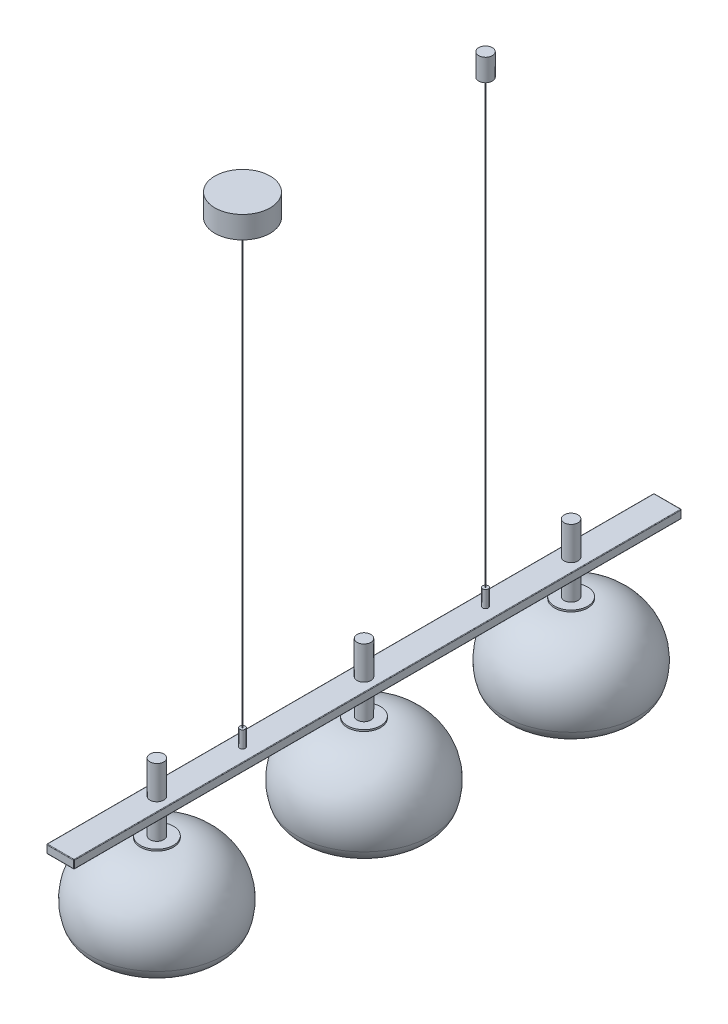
ISO-10303-21;
HEADER;
FILE_DESCRIPTION(('STEP AP214'),'2;1');
FILE_NAME('part.step','',(''),(''),'','','');
FILE_SCHEMA(('AUTOMOTIVE_DESIGN { 1 0 10303 214 1 1 1 1 }'));
ENDSEC;
DATA;
#1=APPLICATION_CONTEXT('core data for automotive mechanical design processes');
#2=APPLICATION_PROTOCOL_DEFINITION('international standard','automotive_design',2000,#1);
#3=PRODUCT_CONTEXT('',#1,'mechanical');
#4=PRODUCT('Part','Part','',(#3));
#5=PRODUCT_RELATED_PRODUCT_CATEGORY('part','',(#4));
#6=PRODUCT_DEFINITION_FORMATION('','',#4);
#7=PRODUCT_DEFINITION_CONTEXT('part definition',#1,'design');
#8=PRODUCT_DEFINITION('design','',#6,#7);
#9=PRODUCT_DEFINITION_SHAPE('','',#8);
#10=(LENGTH_UNIT() NAMED_UNIT(*) SI_UNIT(.MILLI.,.METRE.));
#11=(NAMED_UNIT(*) PLANE_ANGLE_UNIT() SI_UNIT($,.RADIAN.));
#12=(NAMED_UNIT(*) SI_UNIT($,.STERADIAN.) SOLID_ANGLE_UNIT());
#13=UNCERTAINTY_MEASURE_WITH_UNIT(LENGTH_MEASURE(1.E-05),#10,'distance_accuracy_value','');
#14=(GEOMETRIC_REPRESENTATION_CONTEXT(3) GLOBAL_UNCERTAINTY_ASSIGNED_CONTEXT((#13)) GLOBAL_UNIT_ASSIGNED_CONTEXT((#10,
#11,#12)) REPRESENTATION_CONTEXT('',''));
#15=CARTESIAN_POINT('',(0.,0.,0.));
#16=DIRECTION('',(0.,0.,1.));
#17=DIRECTION('',(1.,0.,0.));
#18=AXIS2_PLACEMENT_3D('',#15,#16,#17);
#19=CARTESIAN_POINT('',(-22.881254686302,860.421011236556,830.));
#20=DIRECTION('',(0.,-1.,0.));
#21=DIRECTION('',(0.,0.,-1.));
#22=AXIS2_PLACEMENT_3D('',#19,#20,#21);
#23=CYLINDRICAL_SURFACE('',#22,0.5);
#24=CARTESIAN_POINT('',(-22.881254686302,860.421011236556,830.));
#25=DIRECTION('',(0.,1.,0.));
#26=DIRECTION('',(0.,0.,1.));
#27=AXIS2_PLACEMENT_3D('',#24,#25,#26);
#28=CIRCLE('',#27,0.5);
#29=CARTESIAN_POINT('',(-22.881254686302,860.421011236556,830.5));
#30=VERTEX_POINT('',#29);
#31=EDGE_CURVE('P0_E10',#30,#30,#28,.T.);
#32=ORIENTED_EDGE('',*,*,#31,.F.);
#33=EDGE_LOOP('',(#32));
#34=FACE_BOUND('',#33,.T.);
#35=CARTESIAN_POINT('',(-22.881254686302,60.4210112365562,830.));
#36=DIRECTION('',(0.,1.,0.));
#37=DIRECTION('',(0.,0.,1.));
#38=AXIS2_PLACEMENT_3D('',#35,#36,#37);
#39=CIRCLE('',#38,0.5);
#40=CARTESIAN_POINT('',(-22.881254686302,60.4210112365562,830.5));
#41=VERTEX_POINT('',#40);
#42=EDGE_CURVE('P0_E18',#41,#41,#39,.T.);
#43=ORIENTED_EDGE('',*,*,#42,.T.);
#44=EDGE_LOOP('',(#43));
#45=FACE_BOUND('',#44,.T.);
#46=ADVANCED_FACE('P0_F15',(#34,#45),#23,.T.);
#47=CARTESIAN_POINT('',(-22.881254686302,860.421011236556,830.));
#48=DIRECTION('',(0.,1.,0.));
#49=DIRECTION('',(0.,0.,1.));
#50=AXIS2_PLACEMENT_3D('',#47,#48,#49);
#51=PLANE('',#50);
#52=ORIENTED_EDGE('',*,*,#31,.T.);
#53=EDGE_LOOP('',(#52));
#54=FACE_BOUND('',#53,.T.);
#55=ADVANCED_FACE('P0_F30',(#54),#51,.T.);
#56=CARTESIAN_POINT('',(-22.881254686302,60.4210112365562,830.));
#57=DIRECTION('',(0.,1.,0.));
#58=DIRECTION('',(0.,0.,1.));
#59=AXIS2_PLACEMENT_3D('',#56,#57,#58);
#60=PLANE('',#59);
#61=ORIENTED_EDGE('',*,*,#42,.F.);
#62=EDGE_LOOP('',(#61));
#63=FACE_BOUND('',#62,.T.);
#64=ADVANCED_FACE('P0_F28',(#63),#60,.F.);
#65=CLOSED_SHELL('',(#46,#55,#64));
#66=MANIFOLD_SOLID_BREP('P0_B1',#65);
#67=CARTESIAN_POINT('',(-22.881254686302,860.421011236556,1270.));
#68=DIRECTION('',(0.,-1.,0.));
#69=DIRECTION('',(0.,0.,-1.));
#70=AXIS2_PLACEMENT_3D('',#67,#68,#69);
#71=CYLINDRICAL_SURFACE('',#70,0.5);
#72=CARTESIAN_POINT('',(-22.881254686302,860.421011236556,1270.));
#73=DIRECTION('',(0.,1.,0.));
#74=DIRECTION('',(0.,0.,1.));
#75=AXIS2_PLACEMENT_3D('',#72,#73,#74);
#76=CIRCLE('',#75,0.5);
#77=CARTESIAN_POINT('',(-22.881254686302,860.421011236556,1270.5));
#78=VERTEX_POINT('',#77);
#79=EDGE_CURVE('P1_E10',#78,#78,#76,.T.);
#80=ORIENTED_EDGE('',*,*,#79,.F.);
#81=EDGE_LOOP('',(#80));
#82=FACE_BOUND('',#81,.T.);
#83=CARTESIAN_POINT('',(-22.881254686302,60.4210112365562,1270.));
#84=DIRECTION('',(0.,1.,0.));
#85=DIRECTION('',(0.,0.,1.));
#86=AXIS2_PLACEMENT_3D('',#83,#84,#85);
#87=CIRCLE('',#86,0.5);
#88=CARTESIAN_POINT('',(-22.881254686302,60.4210112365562,1270.5));
#89=VERTEX_POINT('',#88);
#90=EDGE_CURVE('P1_E18',#89,#89,#87,.T.);
#91=ORIENTED_EDGE('',*,*,#90,.T.);
#92=EDGE_LOOP('',(#91));
#93=FACE_BOUND('',#92,.T.);
#94=ADVANCED_FACE('P1_F15',(#82,#93),#71,.T.);
#95=CARTESIAN_POINT('',(-22.881254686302,860.421011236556,1270.));
#96=DIRECTION('',(0.,1.,0.));
#97=DIRECTION('',(0.,0.,1.));
#98=AXIS2_PLACEMENT_3D('',#95,#96,#97);
#99=PLANE('',#98);
#100=ORIENTED_EDGE('',*,*,#79,.T.);
#101=EDGE_LOOP('',(#100));
#102=FACE_BOUND('',#101,.T.);
#103=ADVANCED_FACE('P1_F30',(#102),#99,.T.);
#104=CARTESIAN_POINT('',(-22.881254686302,60.4210112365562,1270.));
#105=DIRECTION('',(0.,1.,0.));
#106=DIRECTION('',(0.,0.,1.));
#107=AXIS2_PLACEMENT_3D('',#104,#105,#106);
#108=PLANE('',#107);
#109=ORIENTED_EDGE('',*,*,#90,.F.);
#110=EDGE_LOOP('',(#109));
#111=FACE_BOUND('',#110,.T.);
#112=ADVANCED_FACE('P1_F28',(#111),#108,.F.);
#113=CLOSED_SHELL('',(#94,#103,#112));
#114=MANIFOLD_SOLID_BREP('P1_B1',#113);
#115=CARTESIAN_POINT('',(-22.881254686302,90.4210112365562,675.));
#116=DIRECTION('',(0.,-1.,0.));
#117=DIRECTION('',(0.,0.,-1.));
#118=AXIS2_PLACEMENT_3D('',#115,#116,#117);
#119=CYLINDRICAL_SURFACE('',#118,12.5);
#120=CARTESIAN_POINT('',(-22.881254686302,90.4210112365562,675.));
#121=DIRECTION('',(0.,1.,0.));
#122=DIRECTION('',(0.,0.,1.));
#123=AXIS2_PLACEMENT_3D('',#120,#121,#122);
#124=CIRCLE('',#123,12.5);
#125=CARTESIAN_POINT('',(-22.881254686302,90.4210112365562,687.5));
#126=VERTEX_POINT('',#125);
#127=EDGE_CURVE('P2_E10',#126,#126,#124,.T.);
#128=ORIENTED_EDGE('',*,*,#127,.F.);
#129=EDGE_LOOP('',(#128));
#130=FACE_BOUND('',#129,.T.);
#131=CARTESIAN_POINT('',(-22.881254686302,30.4210112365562,675.));
#132=DIRECTION('',(0.,1.,0.));
#133=DIRECTION('',(0.,0.,1.));
#134=AXIS2_PLACEMENT_3D('',#131,#132,#133);
#135=CIRCLE('',#134,12.5);
#136=CARTESIAN_POINT('',(-22.881254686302,30.4210112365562,687.5));
#137=VERTEX_POINT('',#136);
#138=EDGE_CURVE('P2_E18',#137,#137,#135,.T.);
#139=ORIENTED_EDGE('',*,*,#138,.T.);
#140=EDGE_LOOP('',(#139));
#141=FACE_BOUND('',#140,.T.);
#142=ADVANCED_FACE('P2_F15',(#130,#141),#119,.T.);
#143=CARTESIAN_POINT('',(-22.881254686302,90.4210112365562,675.));
#144=DIRECTION('',(0.,1.,0.));
#145=DIRECTION('',(0.,0.,1.));
#146=AXIS2_PLACEMENT_3D('',#143,#144,#145);
#147=PLANE('',#146);
#148=ORIENTED_EDGE('',*,*,#127,.T.);
#149=EDGE_LOOP('',(#148));
#150=FACE_BOUND('',#149,.T.);
#151=ADVANCED_FACE('P2_F30',(#150),#147,.T.);
#152=CARTESIAN_POINT('',(-22.881254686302,30.4210112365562,675.));
#153=DIRECTION('',(0.,1.,0.));
#154=DIRECTION('',(0.,0.,1.));
#155=AXIS2_PLACEMENT_3D('',#152,#153,#154);
#156=PLANE('',#155);
#157=ORIENTED_EDGE('',*,*,#138,.F.);
#158=EDGE_LOOP('',(#157));
#159=FACE_BOUND('',#158,.T.);
#160=ADVANCED_FACE('P2_F28',(#159),#156,.F.);
#161=CLOSED_SHELL('',(#142,#151,#160));
#162=MANIFOLD_SOLID_BREP('P2_B1',#161);
#163=CARTESIAN_POINT('',(-22.881254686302,90.4210112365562,1425.));
#164=DIRECTION('',(0.,-1.,0.));
#165=DIRECTION('',(0.,0.,-1.));
#166=AXIS2_PLACEMENT_3D('',#163,#164,#165);
#167=CYLINDRICAL_SURFACE('',#166,12.5);
#168=CARTESIAN_POINT('',(-22.881254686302,90.4210112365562,1425.));
#169=DIRECTION('',(0.,1.,0.));
#170=DIRECTION('',(0.,0.,1.));
#171=AXIS2_PLACEMENT_3D('',#168,#169,#170);
#172=CIRCLE('',#171,12.5);
#173=CARTESIAN_POINT('',(-22.881254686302,90.4210112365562,1437.5));
#174=VERTEX_POINT('',#173);
#175=EDGE_CURVE('P3_E10',#174,#174,#172,.T.);
#176=ORIENTED_EDGE('',*,*,#175,.F.);
#177=EDGE_LOOP('',(#176));
#178=FACE_BOUND('',#177,.T.);
#179=CARTESIAN_POINT('',(-22.881254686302,30.4210112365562,1425.));
#180=DIRECTION('',(0.,1.,0.));
#181=DIRECTION('',(0.,0.,1.));
#182=AXIS2_PLACEMENT_3D('',#179,#180,#181);
#183=CIRCLE('',#182,12.5);
#184=CARTESIAN_POINT('',(-22.881254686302,30.4210112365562,1437.5));
#185=VERTEX_POINT('',#184);
#186=EDGE_CURVE('P3_E18',#185,#185,#183,.T.);
#187=ORIENTED_EDGE('',*,*,#186,.T.);
#188=EDGE_LOOP('',(#187));
#189=FACE_BOUND('',#188,.T.);
#190=ADVANCED_FACE('P3_F15',(#178,#189),#167,.T.);
#191=CARTESIAN_POINT('',(-22.881254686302,90.4210112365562,1425.));
#192=DIRECTION('',(0.,1.,0.));
#193=DIRECTION('',(0.,0.,1.));
#194=AXIS2_PLACEMENT_3D('',#191,#192,#193);
#195=PLANE('',#194);
#196=ORIENTED_EDGE('',*,*,#175,.T.);
#197=EDGE_LOOP('',(#196));
#198=FACE_BOUND('',#197,.T.);
#199=ADVANCED_FACE('P3_F30',(#198),#195,.T.);
#200=CARTESIAN_POINT('',(-22.881254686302,30.4210112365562,1425.));
#201=DIRECTION('',(0.,1.,0.));
#202=DIRECTION('',(0.,0.,1.));
#203=AXIS2_PLACEMENT_3D('',#200,#201,#202);
#204=PLANE('',#203);
#205=ORIENTED_EDGE('',*,*,#186,.F.);
#206=EDGE_LOOP('',(#205));
#207=FACE_BOUND('',#206,.T.);
#208=ADVANCED_FACE('P3_F28',(#207),#204,.F.);
#209=CLOSED_SHELL('',(#190,#199,#208));
#210=MANIFOLD_SOLID_BREP('P3_B1',#209);
#211=CARTESIAN_POINT('',(2.11874531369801,30.4210112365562,1600.));
#212=DIRECTION('',(-1.,0.,0.));
#213=DIRECTION('',(0.,0.,1.));
#214=AXIS2_PLACEMENT_3D('',#211,#212,#213);
#215=PLANE('',#214);
#216=DIRECTION('',(0.,1.,0.));
#217=VECTOR('',#216,1.);
#218=CARTESIAN_POINT('',(2.11874531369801,15.4210112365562,1599.));
#219=LINE('',#218,#217);
#220=CARTESIAN_POINT('',(2.11874531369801,29.4210112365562,1599.));
#221=VERTEX_POINT('',#220);
#222=CARTESIAN_POINT('',(2.11874531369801,16.4210112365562,1599.));
#223=VERTEX_POINT('',#222);
#224=EDGE_CURVE('P4_E137',#221,#223,#219,.F.);
#225=ORIENTED_EDGE('',*,*,#224,.T.);
#226=DIRECTION('',(0.,0.,-1.));
#227=VECTOR('',#226,1.);
#228=CARTESIAN_POINT('',(2.11874531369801,16.4210112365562,1600.));
#229=LINE('',#228,#227);
#230=CARTESIAN_POINT('',(2.11874531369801,16.4210112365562,501.));
#231=VERTEX_POINT('',#230);
#232=EDGE_CURVE('P4_E141',#223,#231,#229,.T.);
#233=ORIENTED_EDGE('',*,*,#232,.T.);
#234=DIRECTION('',(0.,1.,0.));
#235=VECTOR('',#234,1.);
#236=CARTESIAN_POINT('',(2.11874531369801,30.4210112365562,501.));
#237=LINE('',#236,#235);
#238=CARTESIAN_POINT('',(2.11874531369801,29.4210112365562,501.));
#239=VERTEX_POINT('',#238);
#240=EDGE_CURVE('P4_E113',#231,#239,#237,.T.);
#241=ORIENTED_EDGE('',*,*,#240,.T.);
#242=DIRECTION('',(0.,0.,-1.));
#243=VECTOR('',#242,1.);
#244=CARTESIAN_POINT('',(2.11874531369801,29.4210112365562,1600.));
#245=LINE('',#244,#243);
#246=EDGE_CURVE('P4_E131',#239,#221,#245,.F.);
#247=ORIENTED_EDGE('',*,*,#246,.T.);
#248=EDGE_LOOP('',(#225,#233,#241,#247));
#249=FACE_BOUND('',#248,.T.);
#250=ADVANCED_FACE('P4_F17',(#249),#215,.F.);
#251=CARTESIAN_POINT('',(-47.881254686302,30.4210112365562,1600.));
#252=DIRECTION('',(0.,-1.,0.));
#253=DIRECTION('',(0.,0.,-1.));
#254=AXIS2_PLACEMENT_3D('',#251,#252,#253);
#255=PLANE('',#254);
#256=DIRECTION('',(0.,0.,-1.));
#257=VECTOR('',#256,1.);
#258=CARTESIAN_POINT('',(1.11874531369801,30.4210112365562,1600.));
#259=LINE('',#258,#257);
#260=CARTESIAN_POINT('',(1.11874531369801,30.4210112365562,1599.));
#261=VERTEX_POINT('',#260);
#262=CARTESIAN_POINT('',(1.11874531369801,30.4210112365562,501.));
#263=VERTEX_POINT('',#262);
#264=EDGE_CURVE('P4_E154',#261,#263,#259,.T.);
#265=ORIENTED_EDGE('',*,*,#264,.T.);
#266=DIRECTION('',(-1.,0.,0.));
#267=VECTOR('',#266,1.);
#268=CARTESIAN_POINT('',(-47.881254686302,30.4210112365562,501.));
#269=LINE('',#268,#267);
#270=CARTESIAN_POINT('',(-46.881254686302,30.4210112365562,501.));
#271=VERTEX_POINT('',#270);
#272=EDGE_CURVE('P4_E160',#263,#271,#269,.T.);
#273=ORIENTED_EDGE('',*,*,#272,.T.);
#274=DIRECTION('',(0.,0.,-1.));
#275=VECTOR('',#274,1.);
#276=CARTESIAN_POINT('',(-46.881254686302,30.4210112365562,1600.));
#277=LINE('',#276,#275);
#278=CARTESIAN_POINT('',(-46.881254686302,30.4210112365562,1599.));
#279=VERTEX_POINT('',#278);
#280=EDGE_CURVE('P4_E158',#271,#279,#277,.F.);
#281=ORIENTED_EDGE('',*,*,#280,.T.);
#282=DIRECTION('',(-1.,0.,0.));
#283=VECTOR('',#282,1.);
#284=CARTESIAN_POINT('',(2.11874531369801,30.4210112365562,1599.));
#285=LINE('',#284,#283);
#286=EDGE_CURVE('P4_E156',#279,#261,#285,.F.);
#287=ORIENTED_EDGE('',*,*,#286,.T.);
#288=EDGE_LOOP('',(#265,#273,#281,#287));
#289=FACE_BOUND('',#288,.T.);
#290=CARTESIAN_POINT('',(-22.881254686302,30.4210112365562,830.));
#291=DIRECTION('',(0.,-1.,0.));
#292=DIRECTION('',(0.,0.,-1.));
#293=AXIS2_PLACEMENT_3D('',#290,#291,#292);
#294=CIRCLE('',#293,5.);
#295=CARTESIAN_POINT('',(-22.881254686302,30.4210112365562,825.));
#296=VERTEX_POINT('',#295);
#297=EDGE_CURVE('P4_E138',#296,#296,#294,.F.);
#298=ORIENTED_EDGE('',*,*,#297,.F.);
#299=EDGE_LOOP('',(#298));
#300=FACE_BOUND('',#299,.T.);
#301=CARTESIAN_POINT('',(-22.881254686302,30.4210112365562,1270.));
#302=DIRECTION('',(0.,-1.,0.));
#303=DIRECTION('',(0.,0.,-1.));
#304=AXIS2_PLACEMENT_3D('',#301,#302,#303);
#305=CIRCLE('',#304,5.);
#306=CARTESIAN_POINT('',(-22.881254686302,30.4210112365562,1265.));
#307=VERTEX_POINT('',#306);
#308=EDGE_CURVE('P4_E270',#307,#307,#305,.F.);
#309=ORIENTED_EDGE('',*,*,#308,.F.);
#310=EDGE_LOOP('',(#309));
#311=FACE_BOUND('',#310,.T.);
#312=ADVANCED_FACE('P4_F278',(#289,#300,#311),#255,.F.);
#313=CARTESIAN_POINT('',(-47.881254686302,30.4210112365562,1600.));
#314=DIRECTION('',(1.,0.,0.));
#315=DIRECTION('',(0.,0.,-1.));
#316=AXIS2_PLACEMENT_3D('',#313,#314,#315);
#317=PLANE('',#316);
#318=DIRECTION('',(0.,0.,-1.));
#319=VECTOR('',#318,1.);
#320=CARTESIAN_POINT('',(-47.881254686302,29.4210112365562,1600.));
#321=LINE('',#320,#319);
#322=CARTESIAN_POINT('',(-47.881254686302,29.4210112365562,1599.));
#323=VERTEX_POINT('',#322);
#324=CARTESIAN_POINT('',(-47.881254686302,29.4210112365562,501.));
#325=VERTEX_POINT('',#324);
#326=EDGE_CURVE('P4_E174',#323,#325,#321,.T.);
#327=ORIENTED_EDGE('',*,*,#326,.T.);
#328=DIRECTION('',(0.,-1.,0.));
#329=VECTOR('',#328,1.);
#330=CARTESIAN_POINT('',(-47.881254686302,30.4210112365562,501.));
#331=LINE('',#330,#329);
#332=CARTESIAN_POINT('',(-47.881254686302,16.4210112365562,501.));
#333=VERTEX_POINT('',#332);
#334=EDGE_CURVE('P4_E178',#325,#333,#331,.T.);
#335=ORIENTED_EDGE('',*,*,#334,.T.);
#336=DIRECTION('',(0.,0.,-1.));
#337=VECTOR('',#336,1.);
#338=CARTESIAN_POINT('',(-47.881254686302,16.4210112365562,1600.));
#339=LINE('',#338,#337);
#340=CARTESIAN_POINT('',(-47.881254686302,16.4210112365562,1599.));
#341=VERTEX_POINT('',#340);
#342=EDGE_CURVE('P4_E176',#333,#341,#339,.F.);
#343=ORIENTED_EDGE('',*,*,#342,.T.);
#344=DIRECTION('',(0.,-1.,0.));
#345=VECTOR('',#344,1.);
#346=CARTESIAN_POINT('',(-47.881254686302,30.4210112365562,1599.));
#347=LINE('',#346,#345);
#348=EDGE_CURVE('P4_E172',#341,#323,#347,.F.);
#349=ORIENTED_EDGE('',*,*,#348,.T.);
#350=EDGE_LOOP('',(#327,#335,#343,#349));
#351=FACE_BOUND('',#350,.T.);
#352=ADVANCED_FACE('P4_F281',(#351),#317,.F.);
#353=CARTESIAN_POINT('',(-47.881254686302,15.4210112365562,1600.));
#354=DIRECTION('',(0.,1.,0.));
#355=DIRECTION('',(0.,0.,1.));
#356=AXIS2_PLACEMENT_3D('',#353,#354,#355);
#357=PLANE('',#356);
#358=DIRECTION('',(0.,0.,-1.));
#359=VECTOR('',#358,1.);
#360=CARTESIAN_POINT('',(-46.881254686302,15.4210112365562,1600.));
#361=LINE('',#360,#359);
#362=CARTESIAN_POINT('',(-46.881254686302,15.4210112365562,1599.));
#363=VERTEX_POINT('',#362);
#364=CARTESIAN_POINT('',(-46.881254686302,15.4210112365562,501.));
#365=VERTEX_POINT('',#364);
#366=EDGE_CURVE('P4_E167',#363,#365,#361,.T.);
#367=ORIENTED_EDGE('',*,*,#366,.T.);
#368=DIRECTION('',(1.,0.,0.));
#369=VECTOR('',#368,1.);
#370=CARTESIAN_POINT('',(-47.881254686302,15.4210112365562,501.));
#371=LINE('',#370,#369);
#372=CARTESIAN_POINT('',(1.11874531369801,15.4210112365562,501.));
#373=VERTEX_POINT('',#372);
#374=EDGE_CURVE('P4_E169',#365,#373,#371,.T.);
#375=ORIENTED_EDGE('',*,*,#374,.T.);
#376=DIRECTION('',(0.,0.,-1.));
#377=VECTOR('',#376,1.);
#378=CARTESIAN_POINT('',(1.11874531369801,15.4210112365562,1600.));
#379=LINE('',#378,#377);
#380=CARTESIAN_POINT('',(1.11874531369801,15.4210112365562,1599.));
#381=VERTEX_POINT('',#380);
#382=EDGE_CURVE('P4_E163',#373,#381,#379,.F.);
#383=ORIENTED_EDGE('',*,*,#382,.T.);
#384=DIRECTION('',(1.,0.,0.));
#385=VECTOR('',#384,1.);
#386=CARTESIAN_POINT('',(-47.881254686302,15.4210112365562,1599.));
#387=LINE('',#386,#385);
#388=EDGE_CURVE('P4_E165',#381,#363,#387,.F.);
#389=ORIENTED_EDGE('',*,*,#388,.T.);
#390=EDGE_LOOP('',(#367,#375,#383,#389));
#391=FACE_BOUND('',#390,.T.);
#392=CARTESIAN_POINT('',(-22.881254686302,15.4210112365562,675.));
#393=DIRECTION('',(0.,1.,0.));
#394=DIRECTION('',(0.,0.,1.));
#395=AXIS2_PLACEMENT_3D('',#392,#393,#394);
#396=CIRCLE('',#395,12.5);
#397=CARTESIAN_POINT('',(-22.881254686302,15.4210112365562,687.5));
#398=VERTEX_POINT('',#397);
#399=EDGE_CURVE('P4_E267',#398,#398,#396,.F.);
#400=ORIENTED_EDGE('',*,*,#399,.F.);
#401=EDGE_LOOP('',(#400));
#402=FACE_BOUND('',#401,.T.);
#403=CARTESIAN_POINT('',(-22.881254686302,15.4210112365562,1050.));
#404=DIRECTION('',(0.,1.,0.));
#405=DIRECTION('',(0.,0.,1.));
#406=AXIS2_PLACEMENT_3D('',#403,#404,#405);
#407=CIRCLE('',#406,12.5);
#408=CARTESIAN_POINT('',(-22.881254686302,15.4210112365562,1062.5));
#409=VERTEX_POINT('',#408);
#410=EDGE_CURVE('P4_E264',#409,#409,#407,.F.);
#411=ORIENTED_EDGE('',*,*,#410,.F.);
#412=EDGE_LOOP('',(#411));
#413=FACE_BOUND('',#412,.T.);
#414=CARTESIAN_POINT('',(-22.881254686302,15.4210112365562,1425.));
#415=DIRECTION('',(0.,1.,0.));
#416=DIRECTION('',(0.,0.,1.));
#417=AXIS2_PLACEMENT_3D('',#414,#415,#416);
#418=CIRCLE('',#417,12.5);
#419=CARTESIAN_POINT('',(-22.881254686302,15.4210112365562,1437.5));
#420=VERTEX_POINT('',#419);
#421=EDGE_CURVE('P4_E261',#420,#420,#418,.F.);
#422=ORIENTED_EDGE('',*,*,#421,.F.);
#423=EDGE_LOOP('',(#422));
#424=FACE_BOUND('',#423,.T.);
#425=ADVANCED_FACE('P4_F411',(#391,#402,#413,#424),#357,.F.);
#426=CARTESIAN_POINT('',(-22.881254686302,22.9210112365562,1600.));
#427=DIRECTION('',(0.,0.,1.));
#428=DIRECTION('',(1.,0.,0.));
#429=AXIS2_PLACEMENT_3D('',#426,#427,#428);
#430=PLANE('',#429);
#431=DIRECTION('',(-1.,0.,0.));
#432=VECTOR('',#431,1.);
#433=CARTESIAN_POINT('',(-47.881254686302,29.4210112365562,1600.));
#434=LINE('',#433,#432);
#435=CARTESIAN_POINT('',(1.11874531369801,29.4210112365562,1600.));
#436=VERTEX_POINT('',#435);
#437=CARTESIAN_POINT('',(-46.881254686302,29.4210112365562,1600.));
#438=VERTEX_POINT('',#437);
#439=EDGE_CURVE('P4_E40',#436,#438,#434,.T.);
#440=ORIENTED_EDGE('',*,*,#439,.T.);
#441=DIRECTION('',(0.,-1.,0.));
#442=VECTOR('',#441,1.);
#443=CARTESIAN_POINT('',(-46.881254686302,15.4210112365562,1600.));
#444=LINE('',#443,#442);
#445=CARTESIAN_POINT('',(-46.881254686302,16.4210112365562,1600.));
#446=VERTEX_POINT('',#445);
#447=EDGE_CURVE('P4_E11',#438,#446,#444,.T.);
#448=ORIENTED_EDGE('',*,*,#447,.T.);
#449=DIRECTION('',(1.,0.,0.));
#450=VECTOR('',#449,1.);
#451=CARTESIAN_POINT('',(2.11874531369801,16.4210112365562,1600.));
#452=LINE('',#451,#450);
#453=CARTESIAN_POINT('',(1.11874531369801,16.4210112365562,1600.));
#454=VERTEX_POINT('',#453);
#455=EDGE_CURVE('P4_E26',#446,#454,#452,.T.);
#456=ORIENTED_EDGE('',*,*,#455,.T.);
#457=DIRECTION('',(0.,1.,0.));
#458=VECTOR('',#457,1.);
#459=CARTESIAN_POINT('',(1.11874531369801,30.4210112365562,1600.));
#460=LINE('',#459,#458);
#461=EDGE_CURVE('P4_E181',#454,#436,#460,.T.);
#462=ORIENTED_EDGE('',*,*,#461,.T.);
#463=EDGE_LOOP('',(#440,#448,#456,#462));
#464=FACE_BOUND('',#463,.T.);
#465=ADVANCED_FACE('P4_F382',(#464),#430,.T.);
#466=CARTESIAN_POINT('',(-22.881254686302,22.9210112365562,500.));
#467=DIRECTION('',(0.,0.,1.));
#468=DIRECTION('',(1.,0.,0.));
#469=AXIS2_PLACEMENT_3D('',#466,#467,#468);
#470=PLANE('',#469);
#471=DIRECTION('',(-1.,0.,0.));
#472=VECTOR('',#471,1.);
#473=CARTESIAN_POINT('',(-22.881254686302,29.4210112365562,500.));
#474=LINE('',#473,#472);
#475=CARTESIAN_POINT('',(-46.881254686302,29.4210112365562,500.));
#476=VERTEX_POINT('',#475);
#477=CARTESIAN_POINT('',(1.11874531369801,29.4210112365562,500.));
#478=VERTEX_POINT('',#477);
#479=EDGE_CURVE('P4_E151',#476,#478,#474,.F.);
#480=ORIENTED_EDGE('',*,*,#479,.T.);
#481=DIRECTION('',(0.,1.,0.));
#482=VECTOR('',#481,1.);
#483=CARTESIAN_POINT('',(1.11874531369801,22.9210112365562,500.));
#484=LINE('',#483,#482);
#485=CARTESIAN_POINT('',(1.11874531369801,16.4210112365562,500.));
#486=VERTEX_POINT('',#485);
#487=EDGE_CURVE('P4_E115',#478,#486,#484,.F.);
#488=ORIENTED_EDGE('',*,*,#487,.T.);
#489=DIRECTION('',(1.,0.,0.));
#490=VECTOR('',#489,1.);
#491=CARTESIAN_POINT('',(-22.881254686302,16.4210112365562,500.));
#492=LINE('',#491,#490);
#493=CARTESIAN_POINT('',(-46.881254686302,16.4210112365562,500.));
#494=VERTEX_POINT('',#493);
#495=EDGE_CURVE('P4_E149',#486,#494,#492,.F.);
#496=ORIENTED_EDGE('',*,*,#495,.T.);
#497=DIRECTION('',(0.,-1.,0.));
#498=VECTOR('',#497,1.);
#499=CARTESIAN_POINT('',(-46.881254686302,22.9210112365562,500.));
#500=LINE('',#499,#498);
#501=EDGE_CURVE('P4_E144',#494,#476,#500,.F.);
#502=ORIENTED_EDGE('',*,*,#501,.T.);
#503=EDGE_LOOP('',(#480,#488,#496,#502));
#504=FACE_BOUND('',#503,.T.);
#505=ADVANCED_FACE('P4_F395',(#504),#470,.F.);
#506=CARTESIAN_POINT('',(-22.881254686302,-34.5789887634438,1425.));
#507=DIRECTION('',(0.,1.,0.));
#508=DIRECTION('',(0.,0.,1.));
#509=AXIS2_PLACEMENT_3D('',#506,#507,#508);
#510=CYLINDRICAL_SURFACE('',#509,12.5);
#511=CARTESIAN_POINT('',(-22.881254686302,-34.5789887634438,1425.));
#512=DIRECTION('',(0.,-1.,0.));
#513=DIRECTION('',(0.,0.,-1.));
#514=AXIS2_PLACEMENT_3D('',#511,#512,#513);
#515=CIRCLE('',#514,12.5);
#516=CARTESIAN_POINT('',(-22.881254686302,-34.5789887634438,1412.5));
#517=VERTEX_POINT('',#516);
#518=EDGE_CURVE('P4_E258',#517,#517,#515,.T.);
#519=ORIENTED_EDGE('',*,*,#518,.F.);
#520=EDGE_LOOP('',(#519));
#521=FACE_BOUND('',#520,.T.);
#522=ORIENTED_EDGE('',*,*,#421,.T.);
#523=EDGE_LOOP('',(#522));
#524=FACE_BOUND('',#523,.T.);
#525=ADVANCED_FACE('P4_F421',(#521,#524),#510,.T.);
#526=CARTESIAN_POINT('',(-22.881254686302,-34.5789887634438,1425.));
#527=DIRECTION('',(0.,-1.,0.));
#528=DIRECTION('',(0.,0.,-1.));
#529=AXIS2_PLACEMENT_3D('',#526,#527,#528);
#530=PLANE('',#529);
#531=ORIENTED_EDGE('',*,*,#518,.T.);
#532=EDGE_LOOP('',(#531));
#533=FACE_BOUND('',#532,.T.);
#534=ADVANCED_FACE('P4_F423',(#533),#530,.T.);
#535=CARTESIAN_POINT('',(-22.881254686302,-34.5789887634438,1050.));
#536=DIRECTION('',(0.,1.,0.));
#537=DIRECTION('',(0.,0.,1.));
#538=AXIS2_PLACEMENT_3D('',#535,#536,#537);
#539=CYLINDRICAL_SURFACE('',#538,12.5);
#540=CARTESIAN_POINT('',(-22.881254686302,-34.5789887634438,1050.));
#541=DIRECTION('',(0.,-1.,0.));
#542=DIRECTION('',(0.,0.,-1.));
#543=AXIS2_PLACEMENT_3D('',#540,#541,#542);
#544=CIRCLE('',#543,12.5);
#545=CARTESIAN_POINT('',(-22.881254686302,-34.5789887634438,1037.5));
#546=VERTEX_POINT('',#545);
#547=EDGE_CURVE('P4_E255',#546,#546,#544,.T.);
#548=ORIENTED_EDGE('',*,*,#547,.F.);
#549=EDGE_LOOP('',(#548));
#550=FACE_BOUND('',#549,.T.);
#551=ORIENTED_EDGE('',*,*,#410,.T.);
#552=EDGE_LOOP('',(#551));
#553=FACE_BOUND('',#552,.T.);
#554=ADVANCED_FACE('P4_F430',(#550,#553),#539,.T.);
#555=CARTESIAN_POINT('',(-22.881254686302,-34.5789887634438,1050.));
#556=DIRECTION('',(0.,-1.,0.));
#557=DIRECTION('',(0.,0.,-1.));
#558=AXIS2_PLACEMENT_3D('',#555,#556,#557);
#559=PLANE('',#558);
#560=ORIENTED_EDGE('',*,*,#547,.T.);
#561=EDGE_LOOP('',(#560));
#562=FACE_BOUND('',#561,.T.);
#563=ADVANCED_FACE('P4_F479',(#562),#559,.T.);
#564=CARTESIAN_POINT('',(-22.881254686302,-34.5789887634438,675.));
#565=DIRECTION('',(0.,1.,0.));
#566=DIRECTION('',(0.,0.,1.));
#567=AXIS2_PLACEMENT_3D('',#564,#565,#566);
#568=CYLINDRICAL_SURFACE('',#567,12.5);
#569=CARTESIAN_POINT('',(-22.881254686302,-34.5789887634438,675.));
#570=DIRECTION('',(0.,-1.,0.));
#571=DIRECTION('',(0.,0.,-1.));
#572=AXIS2_PLACEMENT_3D('',#569,#570,#571);
#573=CIRCLE('',#572,12.5);
#574=CARTESIAN_POINT('',(-22.881254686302,-34.5789887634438,662.5));
#575=VERTEX_POINT('',#574);
#576=EDGE_CURVE('P4_E250',#575,#575,#573,.T.);
#577=ORIENTED_EDGE('',*,*,#576,.F.);
#578=EDGE_LOOP('',(#577));
#579=FACE_BOUND('',#578,.T.);
#580=ORIENTED_EDGE('',*,*,#399,.T.);
#581=EDGE_LOOP('',(#580));
#582=FACE_BOUND('',#581,.T.);
#583=ADVANCED_FACE('P4_F299',(#579,#582),#568,.T.);
#584=CARTESIAN_POINT('',(-22.881254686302,-34.5789887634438,675.));
#585=DIRECTION('',(0.,-1.,0.));
#586=DIRECTION('',(0.,0.,-1.));
#587=AXIS2_PLACEMENT_3D('',#584,#585,#586);
#588=PLANE('',#587);
#589=ORIENTED_EDGE('',*,*,#576,.T.);
#590=EDGE_LOOP('',(#589));
#591=FACE_BOUND('',#590,.T.);
#592=ADVANCED_FACE('P4_F289',(#591),#588,.T.);
#593=CARTESIAN_POINT('',(-22.881254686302,60.4210112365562,1270.));
#594=DIRECTION('',(0.,-1.,0.));
#595=DIRECTION('',(0.,0.,-1.));
#596=AXIS2_PLACEMENT_3D('',#593,#594,#595);
#597=CYLINDRICAL_SURFACE('',#596,5.);
#598=CARTESIAN_POINT('',(-22.881254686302,60.4210112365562,1270.));
#599=DIRECTION('',(0.,1.,0.));
#600=DIRECTION('',(0.,0.,1.));
#601=AXIS2_PLACEMENT_3D('',#598,#599,#600);
#602=CIRCLE('',#601,5.);
#603=CARTESIAN_POINT('',(-22.881254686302,60.4210112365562,1275.));
#604=VERTEX_POINT('',#603);
#605=EDGE_CURVE('P4_E245',#604,#604,#602,.T.);
#606=ORIENTED_EDGE('',*,*,#605,.F.);
#607=EDGE_LOOP('',(#606));
#608=FACE_BOUND('',#607,.T.);
#609=ORIENTED_EDGE('',*,*,#308,.T.);
#610=EDGE_LOOP('',(#609));
#611=FACE_BOUND('',#610,.T.);
#612=ADVANCED_FACE('P4_F286',(#608,#611),#597,.T.);
#613=CARTESIAN_POINT('',(-22.881254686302,60.4210112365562,1270.));
#614=DIRECTION('',(0.,1.,0.));
#615=DIRECTION('',(0.,0.,1.));
#616=AXIS2_PLACEMENT_3D('',#613,#614,#615);
#617=PLANE('',#616);
#618=ORIENTED_EDGE('',*,*,#605,.T.);
#619=EDGE_LOOP('',(#618));
#620=FACE_BOUND('',#619,.T.);
#621=ADVANCED_FACE('P4_F288',(#620),#617,.T.);
#622=CARTESIAN_POINT('',(-22.881254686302,60.4210112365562,830.));
#623=DIRECTION('',(0.,-1.,0.));
#624=DIRECTION('',(0.,0.,-1.));
#625=AXIS2_PLACEMENT_3D('',#622,#623,#624);
#626=CYLINDRICAL_SURFACE('',#625,5.);
#627=CARTESIAN_POINT('',(-22.881254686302,60.4210112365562,830.));
#628=DIRECTION('',(0.,1.,0.));
#629=DIRECTION('',(0.,0.,1.));
#630=AXIS2_PLACEMENT_3D('',#627,#628,#629);
#631=CIRCLE('',#630,5.);
#632=CARTESIAN_POINT('',(-22.881254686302,60.4210112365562,835.));
#633=VERTEX_POINT('',#632);
#634=EDGE_CURVE('P4_E240',#633,#633,#631,.T.);
#635=ORIENTED_EDGE('',*,*,#634,.F.);
#636=EDGE_LOOP('',(#635));
#637=FACE_BOUND('',#636,.T.);
#638=ORIENTED_EDGE('',*,*,#297,.T.);
#639=EDGE_LOOP('',(#638));
#640=FACE_BOUND('',#639,.T.);
#641=ADVANCED_FACE('P4_F276',(#637,#640),#626,.T.);
#642=CARTESIAN_POINT('',(-22.881254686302,60.4210112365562,830.));
#643=DIRECTION('',(0.,1.,0.));
#644=DIRECTION('',(0.,0.,1.));
#645=AXIS2_PLACEMENT_3D('',#642,#643,#644);
#646=PLANE('',#645);
#647=ORIENTED_EDGE('',*,*,#634,.T.);
#648=EDGE_LOOP('',(#647));
#649=FACE_BOUND('',#648,.T.);
#650=ADVANCED_FACE('P4_F377',(#649),#646,.T.);
#651=CARTESIAN_POINT('',(-46.881254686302,22.9210112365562,1599.));
#652=DIRECTION('',(0.,1.,0.));
#653=DIRECTION('',(0.,0.,1.));
#654=AXIS2_PLACEMENT_3D('',#651,#652,#653);
#655=CYLINDRICAL_SURFACE('',#654,1.);
#656=CARTESIAN_POINT('',(-46.881254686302,16.4210112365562,1599.));
#657=DIRECTION('',(0.,-1.,0.));
#658=DIRECTION('',(0.,0.,-1.));
#659=AXIS2_PLACEMENT_3D('',#656,#657,#658);
#660=CIRCLE('',#659,1.);
#661=EDGE_CURVE('P4_E21',#446,#341,#660,.T.);
#662=ORIENTED_EDGE('',*,*,#661,.F.);
#663=ORIENTED_EDGE('',*,*,#447,.F.);
#664=CARTESIAN_POINT('',(-46.881254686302,29.4210112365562,1599.));
#665=DIRECTION('',(0.,1.,0.));
#666=DIRECTION('',(0.,0.,1.));
#667=AXIS2_PLACEMENT_3D('',#664,#665,#666);
#668=CIRCLE('',#667,1.);
#669=EDGE_CURVE('P4_E233',#323,#438,#668,.T.);
#670=ORIENTED_EDGE('',*,*,#669,.F.);
#671=ORIENTED_EDGE('',*,*,#348,.F.);
#672=EDGE_LOOP('',(#662,#663,#670,#671));
#673=FACE_BOUND('',#672,.T.);
#674=ADVANCED_FACE('P4_F19',(#673),#655,.T.);
#675=CARTESIAN_POINT('',(-46.881254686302,16.4210112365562,1599.));
#676=DIRECTION('',(0.,0.,1.));
#677=DIRECTION('',(1.,0.,0.));
#678=AXIS2_PLACEMENT_3D('',#675,#676,#677);
#679=SPHERICAL_SURFACE('',#678,1.);
#680=CARTESIAN_POINT('',(-46.881254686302,16.4210112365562,1599.));
#681=DIRECTION('',(-1.,0.,0.));
#682=DIRECTION('',(0.,0.,1.));
#683=AXIS2_PLACEMENT_3D('',#680,#681,#682);
#684=CIRCLE('',#683,1.);
#685=EDGE_CURVE('P4_E229',#446,#363,#684,.F.);
#686=ORIENTED_EDGE('',*,*,#685,.F.);
#687=ORIENTED_EDGE('',*,*,#661,.T.);
#688=CARTESIAN_POINT('',(-46.881254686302,16.4210112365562,1599.));
#689=DIRECTION('',(0.,0.,1.));
#690=DIRECTION('',(1.,0.,0.));
#691=AXIS2_PLACEMENT_3D('',#688,#689,#690);
#692=CIRCLE('',#691,1.);
#693=EDGE_CURVE('P4_E231',#363,#341,#692,.F.);
#694=ORIENTED_EDGE('',*,*,#693,.F.);
#695=EDGE_LOOP('',(#686,#687,#694));
#696=FACE_BOUND('',#695,.T.);
#697=ADVANCED_FACE('P4_F372',(#696),#679,.T.);
#698=CARTESIAN_POINT('',(-46.881254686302,29.4210112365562,1599.));
#699=DIRECTION('',(0.,0.,1.));
#700=DIRECTION('',(1.,0.,0.));
#701=AXIS2_PLACEMENT_3D('',#698,#699,#700);
#702=SPHERICAL_SURFACE('',#701,1.);
#703=CARTESIAN_POINT('',(-46.881254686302,29.4210112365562,1599.));
#704=DIRECTION('',(0.,0.,1.));
#705=DIRECTION('',(1.,0.,0.));
#706=AXIS2_PLACEMENT_3D('',#703,#704,#705);
#707=CIRCLE('',#706,1.);
#708=EDGE_CURVE('P4_E223',#323,#279,#707,.F.);
#709=ORIENTED_EDGE('',*,*,#708,.F.);
#710=ORIENTED_EDGE('',*,*,#669,.T.);
#711=CARTESIAN_POINT('',(-46.881254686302,29.4210112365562,1599.));
#712=DIRECTION('',(-1.,0.,0.));
#713=DIRECTION('',(0.,0.,1.));
#714=AXIS2_PLACEMENT_3D('',#711,#712,#713);
#715=CIRCLE('',#714,1.);
#716=EDGE_CURVE('P4_E226',#279,#438,#715,.F.);
#717=ORIENTED_EDGE('',*,*,#716,.F.);
#718=EDGE_LOOP('',(#709,#710,#717));
#719=FACE_BOUND('',#718,.T.);
#720=ADVANCED_FACE('P4_F369',(#719),#702,.T.);
#721=CARTESIAN_POINT('',(-46.881254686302,16.4210112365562,1600.));
#722=DIRECTION('',(0.,0.,-1.));
#723=DIRECTION('',(-1.,0.,0.));
#724=AXIS2_PLACEMENT_3D('',#721,#722,#723);
#725=CYLINDRICAL_SURFACE('',#724,1.);
#726=ORIENTED_EDGE('',*,*,#693,.T.);
#727=ORIENTED_EDGE('',*,*,#342,.F.);
#728=CARTESIAN_POINT('',(-46.881254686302,16.4210112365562,501.));
#729=DIRECTION('',(0.,0.,-1.));
#730=DIRECTION('',(-1.,0.,0.));
#731=AXIS2_PLACEMENT_3D('',#728,#729,#730);
#732=CIRCLE('',#731,1.);
#733=EDGE_CURVE('P4_E218',#365,#333,#732,.T.);
#734=ORIENTED_EDGE('',*,*,#733,.F.);
#735=ORIENTED_EDGE('',*,*,#366,.F.);
#736=EDGE_LOOP('',(#726,#727,#734,#735));
#737=FACE_BOUND('',#736,.T.);
#738=ADVANCED_FACE('P4_F366',(#737),#725,.T.);
#739=CARTESIAN_POINT('',(-22.881254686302,16.4210112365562,1599.));
#740=DIRECTION('',(-1.,0.,0.));
#741=DIRECTION('',(0.,0.,1.));
#742=AXIS2_PLACEMENT_3D('',#739,#740,#741);
#743=CYLINDRICAL_SURFACE('',#742,1.);
#744=ORIENTED_EDGE('',*,*,#685,.T.);
#745=ORIENTED_EDGE('',*,*,#388,.F.);
#746=CARTESIAN_POINT('',(1.11874531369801,16.4210112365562,1599.));
#747=DIRECTION('',(1.,0.,0.));
#748=DIRECTION('',(0.,0.,-1.));
#749=AXIS2_PLACEMENT_3D('',#746,#747,#748);
#750=CIRCLE('',#749,1.);
#751=EDGE_CURVE('P4_E215',#454,#381,#750,.T.);
#752=ORIENTED_EDGE('',*,*,#751,.F.);
#753=ORIENTED_EDGE('',*,*,#455,.F.);
#754=EDGE_LOOP('',(#744,#745,#752,#753));
#755=FACE_BOUND('',#754,.T.);
#756=ADVANCED_FACE('P4_F362',(#755),#743,.T.);
#757=CARTESIAN_POINT('',(1.11874531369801,22.9210112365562,1599.));
#758=DIRECTION('',(0.,-1.,0.));
#759=DIRECTION('',(0.,0.,-1.));
#760=AXIS2_PLACEMENT_3D('',#757,#758,#759);
#761=CYLINDRICAL_SURFACE('',#760,1.);
#762=CARTESIAN_POINT('',(1.11874531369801,29.4210112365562,1599.));
#763=DIRECTION('',(0.,1.,0.));
#764=DIRECTION('',(0.,0.,1.));
#765=AXIS2_PLACEMENT_3D('',#762,#763,#764);
#766=CIRCLE('',#765,1.);
#767=EDGE_CURVE('P4_E209',#436,#221,#766,.T.);
#768=ORIENTED_EDGE('',*,*,#767,.F.);
#769=ORIENTED_EDGE('',*,*,#461,.F.);
#770=CARTESIAN_POINT('',(1.11874531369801,16.4210112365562,1599.));
#771=DIRECTION('',(0.,-1.,0.));
#772=DIRECTION('',(0.,0.,-1.));
#773=AXIS2_PLACEMENT_3D('',#770,#771,#772);
#774=CIRCLE('',#773,1.);
#775=EDGE_CURVE('P4_E212',#223,#454,#774,.T.);
#776=ORIENTED_EDGE('',*,*,#775,.F.);
#777=ORIENTED_EDGE('',*,*,#224,.F.);
#778=EDGE_LOOP('',(#768,#769,#776,#777));
#779=FACE_BOUND('',#778,.T.);
#780=ADVANCED_FACE('P4_F358',(#779),#761,.T.);
#781=CARTESIAN_POINT('',(-22.881254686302,29.4210112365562,1599.));
#782=DIRECTION('',(1.,0.,0.));
#783=DIRECTION('',(0.,0.,-1.));
#784=AXIS2_PLACEMENT_3D('',#781,#782,#783);
#785=CYLINDRICAL_SURFACE('',#784,1.);
#786=ORIENTED_EDGE('',*,*,#716,.T.);
#787=ORIENTED_EDGE('',*,*,#439,.F.);
#788=CARTESIAN_POINT('',(1.11874531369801,29.4210112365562,1599.));
#789=DIRECTION('',(1.,0.,0.));
#790=DIRECTION('',(0.,0.,-1.));
#791=AXIS2_PLACEMENT_3D('',#788,#789,#790);
#792=CIRCLE('',#791,1.);
#793=EDGE_CURVE('P4_E206',#261,#436,#792,.T.);
#794=ORIENTED_EDGE('',*,*,#793,.F.);
#795=ORIENTED_EDGE('',*,*,#286,.F.);
#796=EDGE_LOOP('',(#786,#787,#794,#795));
#797=FACE_BOUND('',#796,.T.);
#798=ADVANCED_FACE('P4_F354',(#797),#785,.T.);
#799=CARTESIAN_POINT('',(-46.881254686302,29.4210112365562,1600.));
#800=DIRECTION('',(0.,0.,-1.));
#801=DIRECTION('',(-1.,0.,0.));
#802=AXIS2_PLACEMENT_3D('',#799,#800,#801);
#803=CYLINDRICAL_SURFACE('',#802,1.);
#804=ORIENTED_EDGE('',*,*,#708,.T.);
#805=ORIENTED_EDGE('',*,*,#280,.F.);
#806=CARTESIAN_POINT('',(-46.881254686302,29.4210112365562,501.));
#807=DIRECTION('',(0.,0.,-1.));
#808=DIRECTION('',(-1.,0.,0.));
#809=AXIS2_PLACEMENT_3D('',#806,#807,#808);
#810=CIRCLE('',#809,1.);
#811=EDGE_CURVE('P4_E203',#325,#271,#810,.T.);
#812=ORIENTED_EDGE('',*,*,#811,.F.);
#813=ORIENTED_EDGE('',*,*,#326,.F.);
#814=EDGE_LOOP('',(#804,#805,#812,#813));
#815=FACE_BOUND('',#814,.T.);
#816=ADVANCED_FACE('P4_F350',(#815),#803,.T.);
#817=CARTESIAN_POINT('',(-46.881254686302,30.4210112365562,501.));
#818=DIRECTION('',(0.,-1.,0.));
#819=DIRECTION('',(0.,0.,-1.));
#820=AXIS2_PLACEMENT_3D('',#817,#818,#819);
#821=CYLINDRICAL_SURFACE('',#820,1.);
#822=CARTESIAN_POINT('',(-46.881254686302,16.4210112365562,501.));
#823=DIRECTION('',(0.,-1.,0.));
#824=DIRECTION('',(0.,0.,-1.));
#825=AXIS2_PLACEMENT_3D('',#822,#823,#824);
#826=CIRCLE('',#825,1.);
#827=EDGE_CURVE('P4_E220',#333,#494,#826,.T.);
#828=ORIENTED_EDGE('',*,*,#827,.F.);
#829=ORIENTED_EDGE('',*,*,#334,.F.);
#830=CARTESIAN_POINT('',(-46.881254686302,29.4210112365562,501.));
#831=DIRECTION('',(0.,1.,0.));
#832=DIRECTION('',(0.,0.,1.));
#833=AXIS2_PLACEMENT_3D('',#830,#831,#832);
#834=CIRCLE('',#833,1.);
#835=EDGE_CURVE('P4_E200',#476,#325,#834,.T.);
#836=ORIENTED_EDGE('',*,*,#835,.F.);
#837=ORIENTED_EDGE('',*,*,#501,.F.);
#838=EDGE_LOOP('',(#828,#829,#836,#837));
#839=FACE_BOUND('',#838,.T.);
#840=ADVANCED_FACE('P4_F346',(#839),#821,.T.);
#841=CARTESIAN_POINT('',(-46.881254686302,16.4210112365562,501.));
#842=DIRECTION('',(0.,0.,1.));
#843=DIRECTION('',(1.,0.,0.));
#844=AXIS2_PLACEMENT_3D('',#841,#842,#843);
#845=SPHERICAL_SURFACE('',#844,1.);
#846=ORIENTED_EDGE('',*,*,#733,.T.);
#847=ORIENTED_EDGE('',*,*,#827,.T.);
#848=CARTESIAN_POINT('',(-46.881254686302,16.4210112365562,501.));
#849=DIRECTION('',(-1.,0.,0.));
#850=DIRECTION('',(0.,0.,1.));
#851=AXIS2_PLACEMENT_3D('',#848,#849,#850);
#852=CIRCLE('',#851,1.);
#853=EDGE_CURVE('P4_E197',#365,#494,#852,.F.);
#854=ORIENTED_EDGE('',*,*,#853,.F.);
#855=EDGE_LOOP('',(#846,#847,#854));
#856=FACE_BOUND('',#855,.T.);
#857=ADVANCED_FACE('P4_F342',(#856),#845,.T.);
#858=CARTESIAN_POINT('',(1.11874531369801,16.4210112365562,1599.));
#859=DIRECTION('',(0.,0.,1.));
#860=DIRECTION('',(1.,0.,0.));
#861=AXIS2_PLACEMENT_3D('',#858,#859,#860);
#862=SPHERICAL_SURFACE('',#861,1.);
#863=ORIENTED_EDGE('',*,*,#775,.T.);
#864=ORIENTED_EDGE('',*,*,#751,.T.);
#865=CARTESIAN_POINT('',(1.11874531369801,16.4210112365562,1599.));
#866=DIRECTION('',(0.,0.,1.));
#867=DIRECTION('',(1.,0.,0.));
#868=AXIS2_PLACEMENT_3D('',#865,#866,#867);
#869=CIRCLE('',#868,1.);
#870=EDGE_CURVE('P4_E194',#223,#381,#869,.F.);
#871=ORIENTED_EDGE('',*,*,#870,.F.);
#872=EDGE_LOOP('',(#863,#864,#871));
#873=FACE_BOUND('',#872,.T.);
#874=ADVANCED_FACE('P4_F338',(#873),#862,.T.);
#875=CARTESIAN_POINT('',(1.11874531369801,29.4210112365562,1599.));
#876=DIRECTION('',(0.,0.,1.));
#877=DIRECTION('',(1.,0.,0.));
#878=AXIS2_PLACEMENT_3D('',#875,#876,#877);
#879=SPHERICAL_SURFACE('',#878,1.);
#880=ORIENTED_EDGE('',*,*,#793,.T.);
#881=ORIENTED_EDGE('',*,*,#767,.T.);
#882=CARTESIAN_POINT('',(1.11874531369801,29.4210112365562,1599.));
#883=DIRECTION('',(0.,0.,1.));
#884=DIRECTION('',(1.,0.,0.));
#885=AXIS2_PLACEMENT_3D('',#882,#883,#884);
#886=CIRCLE('',#885,1.);
#887=EDGE_CURVE('P4_E134',#261,#221,#886,.F.);
#888=ORIENTED_EDGE('',*,*,#887,.F.);
#889=EDGE_LOOP('',(#880,#881,#888));
#890=FACE_BOUND('',#889,.T.);
#891=ADVANCED_FACE('P4_F334',(#890),#879,.T.);
#892=CARTESIAN_POINT('',(-46.881254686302,29.4210112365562,501.));
#893=DIRECTION('',(0.,0.,1.));
#894=DIRECTION('',(1.,0.,0.));
#895=AXIS2_PLACEMENT_3D('',#892,#893,#894);
#896=SPHERICAL_SURFACE('',#895,1.);
#897=ORIENTED_EDGE('',*,*,#835,.T.);
#898=ORIENTED_EDGE('',*,*,#811,.T.);
#899=CARTESIAN_POINT('',(-46.881254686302,29.4210112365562,501.));
#900=DIRECTION('',(-1.,0.,0.));
#901=DIRECTION('',(0.,0.,1.));
#902=AXIS2_PLACEMENT_3D('',#899,#900,#901);
#903=CIRCLE('',#902,1.);
#904=EDGE_CURVE('P4_E191',#476,#271,#903,.F.);
#905=ORIENTED_EDGE('',*,*,#904,.F.);
#906=EDGE_LOOP('',(#897,#898,#905));
#907=FACE_BOUND('',#906,.T.);
#908=ADVANCED_FACE('P4_F330',(#907),#896,.T.);
#909=CARTESIAN_POINT('',(-47.881254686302,16.4210112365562,501.));
#910=DIRECTION('',(1.,0.,0.));
#911=DIRECTION('',(0.,0.,-1.));
#912=AXIS2_PLACEMENT_3D('',#909,#910,#911);
#913=CYLINDRICAL_SURFACE('',#912,1.);
#914=ORIENTED_EDGE('',*,*,#853,.T.);
#915=ORIENTED_EDGE('',*,*,#495,.F.);
#916=CARTESIAN_POINT('',(1.11874531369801,16.4210112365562,501.));
#917=DIRECTION('',(1.,0.,0.));
#918=DIRECTION('',(0.,0.,-1.));
#919=AXIS2_PLACEMENT_3D('',#916,#917,#918);
#920=CIRCLE('',#919,1.);
#921=EDGE_CURVE('P4_E188',#373,#486,#920,.T.);
#922=ORIENTED_EDGE('',*,*,#921,.F.);
#923=ORIENTED_EDGE('',*,*,#374,.F.);
#924=EDGE_LOOP('',(#914,#915,#922,#923));
#925=FACE_BOUND('',#924,.T.);
#926=ADVANCED_FACE('P4_F326',(#925),#913,.T.);
#927=CARTESIAN_POINT('',(1.11874531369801,16.4210112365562,1600.));
#928=DIRECTION('',(0.,0.,-1.));
#929=DIRECTION('',(-1.,0.,0.));
#930=AXIS2_PLACEMENT_3D('',#927,#928,#929);
#931=CYLINDRICAL_SURFACE('',#930,1.);
#932=ORIENTED_EDGE('',*,*,#870,.T.);
#933=ORIENTED_EDGE('',*,*,#382,.F.);
#934=CARTESIAN_POINT('',(1.11874531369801,16.4210112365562,501.));
#935=DIRECTION('',(0.,0.,-1.));
#936=DIRECTION('',(-1.,0.,0.));
#937=AXIS2_PLACEMENT_3D('',#934,#935,#936);
#938=CIRCLE('',#937,1.);
#939=EDGE_CURVE('P4_E128',#231,#373,#938,.T.);
#940=ORIENTED_EDGE('',*,*,#939,.F.);
#941=ORIENTED_EDGE('',*,*,#232,.F.);
#942=EDGE_LOOP('',(#932,#933,#940,#941));
#943=FACE_BOUND('',#942,.T.);
#944=ADVANCED_FACE('P4_F323',(#943),#931,.T.);
#945=CARTESIAN_POINT('',(1.11874531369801,29.4210112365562,1600.));
#946=DIRECTION('',(0.,0.,-1.));
#947=DIRECTION('',(-1.,0.,0.));
#948=AXIS2_PLACEMENT_3D('',#945,#946,#947);
#949=CYLINDRICAL_SURFACE('',#948,1.);
#950=ORIENTED_EDGE('',*,*,#887,.T.);
#951=ORIENTED_EDGE('',*,*,#246,.F.);
#952=CARTESIAN_POINT('',(1.11874531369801,29.4210112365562,501.));
#953=DIRECTION('',(0.,0.,-1.));
#954=DIRECTION('',(-1.,0.,0.));
#955=AXIS2_PLACEMENT_3D('',#952,#953,#954);
#956=CIRCLE('',#955,1.);
#957=EDGE_CURVE('P4_E121',#263,#239,#956,.T.);
#958=ORIENTED_EDGE('',*,*,#957,.F.);
#959=ORIENTED_EDGE('',*,*,#264,.F.);
#960=EDGE_LOOP('',(#950,#951,#958,#959));
#961=FACE_BOUND('',#960,.T.);
#962=ADVANCED_FACE('P4_F132',(#961),#949,.T.);
#963=CARTESIAN_POINT('',(-47.881254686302,29.4210112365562,501.));
#964=DIRECTION('',(-1.,0.,0.));
#965=DIRECTION('',(0.,0.,1.));
#966=AXIS2_PLACEMENT_3D('',#963,#964,#965);
#967=CYLINDRICAL_SURFACE('',#966,1.);
#968=ORIENTED_EDGE('',*,*,#904,.T.);
#969=ORIENTED_EDGE('',*,*,#272,.F.);
#970=CARTESIAN_POINT('',(1.11874531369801,29.4210112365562,501.));
#971=DIRECTION('',(1.,0.,0.));
#972=DIRECTION('',(0.,0.,-1.));
#973=AXIS2_PLACEMENT_3D('',#970,#971,#972);
#974=CIRCLE('',#973,1.);
#975=EDGE_CURVE('P4_E125',#478,#263,#974,.T.);
#976=ORIENTED_EDGE('',*,*,#975,.F.);
#977=ORIENTED_EDGE('',*,*,#479,.F.);
#978=EDGE_LOOP('',(#968,#969,#976,#977));
#979=FACE_BOUND('',#978,.T.);
#980=ADVANCED_FACE('P4_F316',(#979),#967,.T.);
#981=CARTESIAN_POINT('',(1.11874531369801,16.4210112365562,501.));
#982=DIRECTION('',(0.,0.,1.));
#983=DIRECTION('',(1.,0.,0.));
#984=AXIS2_PLACEMENT_3D('',#981,#982,#983);
#985=SPHERICAL_SURFACE('',#984,1.);
#986=ORIENTED_EDGE('',*,*,#939,.T.);
#987=ORIENTED_EDGE('',*,*,#921,.T.);
#988=CARTESIAN_POINT('',(1.11874531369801,16.4210112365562,501.));
#989=DIRECTION('',(0.,-1.,0.));
#990=DIRECTION('',(1.,0.,0.));
#991=AXIS2_PLACEMENT_3D('',#988,#989,#990);
#992=CIRCLE('',#991,1.);
#993=EDGE_CURVE('P4_E118',#231,#486,#992,.F.);
#994=ORIENTED_EDGE('',*,*,#993,.F.);
#995=EDGE_LOOP('',(#986,#987,#994));
#996=FACE_BOUND('',#995,.T.);
#997=ADVANCED_FACE('P4_F313',(#996),#985,.T.);
#998=CARTESIAN_POINT('',(1.11874531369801,29.4210112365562,501.));
#999=DIRECTION('',(0.,0.,1.));
#1000=DIRECTION('',(1.,0.,0.));
#1001=AXIS2_PLACEMENT_3D('',#998,#999,#1000);
#1002=SPHERICAL_SURFACE('',#1001,1.);
#1003=ORIENTED_EDGE('',*,*,#975,.T.);
#1004=ORIENTED_EDGE('',*,*,#957,.T.);
#1005=CARTESIAN_POINT('',(1.11874531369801,29.4210112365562,501.));
#1006=DIRECTION('',(0.,1.,0.));
#1007=DIRECTION('',(0.,0.,1.));
#1008=AXIS2_PLACEMENT_3D('',#1005,#1006,#1007);
#1009=CIRCLE('',#1008,1.);
#1010=EDGE_CURVE('P4_E109',#478,#239,#1009,.F.);
#1011=ORIENTED_EDGE('',*,*,#1010,.F.);
#1012=EDGE_LOOP('',(#1003,#1004,#1011));
#1013=FACE_BOUND('',#1012,.T.);
#1014=ADVANCED_FACE('P4_F123',(#1013),#1002,.T.);
#1015=CARTESIAN_POINT('',(1.11874531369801,30.4210112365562,501.));
#1016=DIRECTION('',(0.,1.,0.));
#1017=DIRECTION('',(0.,0.,1.));
#1018=AXIS2_PLACEMENT_3D('',#1015,#1016,#1017);
#1019=CYLINDRICAL_SURFACE('',#1018,1.);
#1020=ORIENTED_EDGE('',*,*,#993,.T.);
#1021=ORIENTED_EDGE('',*,*,#487,.F.);
#1022=ORIENTED_EDGE('',*,*,#1010,.T.);
#1023=ORIENTED_EDGE('',*,*,#240,.F.);
#1024=EDGE_LOOP('',(#1020,#1021,#1022,#1023));
#1025=FACE_BOUND('',#1024,.T.);
#1026=ADVANCED_FACE('P4_F111',(#1025),#1019,.T.);
#1027=CLOSED_SHELL('',(#250,#312,#352,#425,#465,#505,#525,#534,#554,#563,#583,#592,#612,#621,
#641,#650,#674,#697,#720,#738,#756,#780,#798,#816,#840,#857,#874,#891,#908,#926,#944,#962,#980,
#997,#1014,#1026));
#1028=MANIFOLD_SOLID_BREP('P4_B1',#1027);
#1029=CARTESIAN_POINT('',(-21.0820898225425,-114.544595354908,675.));
#1030=DIRECTION('',(0.,0.,1.));
#1031=DIRECTION('',(1.,0.,0.));
#1032=AXIS2_PLACEMENT_3D('',#1029,#1030,#1031);
#1033=CIRCLE('',#1032,40.);
#1034=TRIMMED_CURVE('',#1033,(PARAMETER_VALUE(-1.61579062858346)),
(PARAMETER_VALUE(1.61579062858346)),.T.,.PARAMETER.);
#1035=CARTESIAN_POINT('',(-22.8812546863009,-114.544595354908,675.));
#1036=DIRECTION('',(0.,1.,0.));
#1037=AXIS1_PLACEMENT('',#1035,#1036);
#1038=SURFACE_OF_REVOLUTION('',#1034,#1037);
#1039=CARTESIAN_POINT('',(-22.8812546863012,-76.5789887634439,675.));
#1040=DIRECTION('',(0.,1.,0.));
#1041=DIRECTION('',(1.,0.,0.));
#1042=AXIS2_PLACEMENT_3D('',#1039,#1040,#1041);
#1043=CIRCLE('',#1042,14.3933189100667);
#1044=CARTESIAN_POINT('',(-8.48793577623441,-76.5789887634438,675.));
#1045=VERTEX_POINT('',#1044);
#1046=EDGE_CURVE('P5_E10',#1045,#1045,#1043,.T.);
#1047=ORIENTED_EDGE('',*,*,#1046,.F.);
#1048=EDGE_LOOP('',(#1047));
#1049=FACE_BOUND('',#1048,.T.);
#1050=CARTESIAN_POINT('',(-22.8812546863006,-154.504112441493,675.));
#1051=VERTEX_POINT('',#1050);
#1052=VERTEX_LOOP('',#1051);
#1053=FACE_BOUND('',#1052,.T.);
#1054=ADVANCED_FACE('P5_F16',(#1049,#1053),#1038,.T.);
#1055=CARTESIAN_POINT('',(-37.2745735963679,-76.578988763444,675.));
#1056=DIRECTION('',(0.,-1.,0.));
#1057=DIRECTION('',(-1.,0.,0.));
#1058=AXIS2_PLACEMENT_3D('',#1055,#1056,#1057);
#1059=PLANE('',#1058);
#1060=ORIENTED_EDGE('',*,*,#1046,.T.);
#1061=EDGE_LOOP('',(#1060));
#1062=FACE_BOUND('',#1061,.T.);
#1063=ADVANCED_FACE('P5_F24',(#1062),#1059,.F.);
#1064=CLOSED_SHELL('',(#1054,#1063));
#1065=MANIFOLD_SOLID_BREP('P5_B1',#1064);
#1066=CARTESIAN_POINT('',(-22.8812546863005,-114.544595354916,1051.79916486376));
#1067=DIRECTION('',(-1.,0.,0.));
#1068=DIRECTION('',(0.,0.,1.));
#1069=AXIS2_PLACEMENT_3D('',#1066,#1067,#1068);
#1070=CIRCLE('',#1069,40.);
#1071=TRIMMED_CURVE('',#1070,(PARAMETER_VALUE(-1.61579062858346)),
(PARAMETER_VALUE(1.61579062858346)),.T.,.PARAMETER.);
#1072=CARTESIAN_POINT('',(-22.8812546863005,-114.544595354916,1050.));
#1073=DIRECTION('',(0.,1.,0.));
#1074=AXIS1_PLACEMENT('',#1072,#1073);
#1075=SURFACE_OF_REVOLUTION('',#1071,#1074);
#1076=CARTESIAN_POINT('',(-22.8812546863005,-76.5789887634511,1050.));
#1077=DIRECTION('',(0.,1.,0.));
#1078=DIRECTION('',(0.,0.,1.));
#1079=AXIS2_PLACEMENT_3D('',#1076,#1077,#1078);
#1080=CIRCLE('',#1079,14.3933189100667);
#1081=CARTESIAN_POINT('',(-22.8812546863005,-76.5789887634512,1064.39331891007));
#1082=VERTEX_POINT('',#1081);
#1083=EDGE_CURVE('P6_E11',#1082,#1082,#1080,.T.);
#1084=ORIENTED_EDGE('',*,*,#1083,.F.);
#1085=EDGE_LOOP('',(#1084));
#1086=FACE_BOUND('',#1085,.T.);
#1087=CARTESIAN_POINT('',(-22.8812546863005,-154.5041124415,1050.));
#1088=VERTEX_POINT('',#1087);
#1089=VERTEX_LOOP('',#1088);
#1090=FACE_BOUND('',#1089,.T.);
#1091=ADVANCED_FACE('P6_F17',(#1086,#1090),#1075,.T.);
#1092=CARTESIAN_POINT('',(-22.8812546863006,-76.578988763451,1035.60668108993));
#1093=DIRECTION('',(0.,-1.,0.));
#1094=DIRECTION('',(0.,0.,-1.));
#1095=AXIS2_PLACEMENT_3D('',#1092,#1093,#1094);
#1096=PLANE('',#1095);
#1097=ORIENTED_EDGE('',*,*,#1083,.T.);
#1098=EDGE_LOOP('',(#1097));
#1099=FACE_BOUND('',#1098,.T.);
#1100=ADVANCED_FACE('P6_F25',(#1099),#1096,.F.);
#1101=CLOSED_SHELL('',(#1091,#1100));
#1102=MANIFOLD_SOLID_BREP('P6_B1',#1101);
#1103=CARTESIAN_POINT('',(-21.8972120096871,-114.544595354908,1423.49379476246));
#1104=DIRECTION('',(0.83716910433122,0.,0.546944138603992));
#1105=DIRECTION('',(0.546944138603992,0.,-0.83716910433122));
#1106=AXIS2_PLACEMENT_3D('',#1103,#1104,#1105);
#1107=CIRCLE('',#1106,40.);
#1108=TRIMMED_CURVE('',#1107,(PARAMETER_VALUE(-1.61579062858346)),
(PARAMETER_VALUE(1.61579062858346)),.T.,.PARAMETER.);
#1109=CARTESIAN_POINT('',(-22.881254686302,-114.544595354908,1425.));
#1110=DIRECTION('',(0.,1.,0.));
#1111=AXIS1_PLACEMENT('',#1109,#1110);
#1112=SURFACE_OF_REVOLUTION('',#1108,#1111);
#1113=CARTESIAN_POINT('',(-22.881254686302,-76.5789887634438,1425.));
#1114=DIRECTION('',(0.,1.,0.));
#1115=DIRECTION('',(0.546944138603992,0.,-0.83716910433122));
#1116=AXIS2_PLACEMENT_3D('',#1113,#1114,#1115);
#1117=CIRCLE('',#1116,14.3933189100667);
#1118=CARTESIAN_POINT('',(-15.008913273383,-76.5789887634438,1412.95035809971));
#1119=VERTEX_POINT('',#1118);
#1120=EDGE_CURVE('P7_E11',#1119,#1119,#1117,.T.);
#1121=ORIENTED_EDGE('',*,*,#1120,.F.);
#1122=EDGE_LOOP('',(#1121));
#1123=FACE_BOUND('',#1122,.T.);
#1124=CARTESIAN_POINT('',(-22.881254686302,-154.504112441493,1425.));
#1125=VERTEX_POINT('',#1124);
#1126=VERTEX_LOOP('',#1125);
#1127=FACE_BOUND('',#1126,.T.);
#1128=ADVANCED_FACE('P7_F17',(#1123,#1127),#1112,.T.);
#1129=CARTESIAN_POINT('',(-30.753596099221,-76.5789887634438,1437.04964190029));
#1130=DIRECTION('',(0.,-1.,0.));
#1131=DIRECTION('',(-0.546944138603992,0.,0.83716910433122));
#1132=AXIS2_PLACEMENT_3D('',#1129,#1130,#1131);
#1133=PLANE('',#1132);
#1134=ORIENTED_EDGE('',*,*,#1120,.T.);
#1135=EDGE_LOOP('',(#1134));
#1136=FACE_BOUND('',#1135,.T.);
#1137=ADVANCED_FACE('P7_F25',(#1136),#1133,.F.);
#1138=CLOSED_SHELL('',(#1128,#1137));
#1139=MANIFOLD_SOLID_BREP('P7_B1',#1138);
#1140=CARTESIAN_POINT('',(-22.881254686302,-34.5789887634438,675.));
#1141=DIRECTION('',(0.,1.,0.));
#1142=DIRECTION('',(-1.,0.,0.));
#1143=AXIS2_PLACEMENT_3D('',#1140,#1141,#1142);
#1144=PLANE('',#1143);
#1145=CARTESIAN_POINT('',(-22.881254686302,-34.5789887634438,675.));
#1146=DIRECTION('',(0.,1.,0.));
#1147=DIRECTION('',(0.,0.,1.));
#1148=AXIS2_PLACEMENT_3D('',#1145,#1146,#1147);
#1149=CIRCLE('',#1148,12.5);
#1150=CARTESIAN_POINT('',(-22.881254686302,-34.5789887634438,687.5));
#1151=VERTEX_POINT('',#1150);
#1152=EDGE_CURVE('P8_E40',#1151,#1151,#1149,.T.);
#1153=ORIENTED_EDGE('',*,*,#1152,.F.);
#1154=EDGE_LOOP('',(#1153));
#1155=FACE_BOUND('',#1154,.T.);
#1156=CARTESIAN_POINT('',(-22.881254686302,-34.5789887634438,675.));
#1157=DIRECTION('',(0.,-1.,0.));
#1158=DIRECTION('',(1.,0.,0.));
#1159=AXIS2_PLACEMENT_3D('',#1156,#1157,#1158);
#1160=CIRCLE('',#1159,30.);
#1161=CARTESIAN_POINT('',(7.11874531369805,-34.5789887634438,675.));
#1162=VERTEX_POINT('',#1161);
#1163=EDGE_CURVE('P8_E10',#1162,#1162,#1160,.T.);
#1164=ORIENTED_EDGE('',*,*,#1163,.F.);
#1165=EDGE_LOOP('',(#1164));
#1166=FACE_BOUND('',#1165,.T.);
#1167=ADVANCED_FACE('P8_F15',(#1155,#1166),#1144,.T.);
#1168=CARTESIAN_POINT('',(-22.881254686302,-130.521878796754,675.));
#1169=DIRECTION('',(0.,-1.,0.));
#1170=DIRECTION('',(1.,0.,0.));
#1171=AXIS2_PLACEMENT_3D('',#1168,#1169,#1170);
#1172=DEGENERATE_TOROIDAL_SURFACE('',#1171,30.,95.9428900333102,.T.);
#1173=ORIENTED_EDGE('',*,*,#1163,.T.);
#1174=EDGE_LOOP('',(#1173));
#1175=FACE_BOUND('',#1174,.T.);
#1176=CARTESIAN_POINT('',(-22.881254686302,-158.388605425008,675.));
#1177=DIRECTION('',(0.,-1.,0.));
#1178=DIRECTION('',(1.,0.,0.));
#1179=AXIS2_PLACEMENT_3D('',#1176,#1177,#1178);
#1180=CIRCLE('',#1179,121.806773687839);
#1181=CARTESIAN_POINT('',(98.9255190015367,-158.388605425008,675.));
#1182=VERTEX_POINT('',#1181);
#1183=EDGE_CURVE('P8_E22',#1182,#1182,#1180,.T.);
#1184=ORIENTED_EDGE('',*,*,#1183,.F.);
#1185=EDGE_LOOP('',(#1184));
#1186=FACE_BOUND('',#1185,.T.);
#1187=ADVANCED_FACE('P8_F68',(#1175,#1186),#1172,.T.);
#1188=CARTESIAN_POINT('',(-22.881254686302,-146.770557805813,675.));
#1189=DIRECTION('',(0.,-1.,0.));
#1190=DIRECTION('',(1.,0.,0.));
#1191=AXIS2_PLACEMENT_3D('',#1188,#1189,#1190);
#1192=TOROIDAL_SURFACE('',#1191,83.531181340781,40.0000000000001);
#1193=ORIENTED_EDGE('',*,*,#1183,.T.);
#1194=EDGE_LOOP('',(#1193));
#1195=FACE_BOUND('',#1194,.T.);
#1196=CARTESIAN_POINT('',(-22.881254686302,-186.770557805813,675.));
#1197=DIRECTION('',(0.,-1.,0.));
#1198=DIRECTION('',(1.,0.,0.));
#1199=AXIS2_PLACEMENT_3D('',#1196,#1197,#1198);
#1200=CIRCLE('',#1199,83.531181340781);
#1201=CARTESIAN_POINT('',(60.6499266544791,-186.770557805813,675.));
#1202=VERTEX_POINT('',#1201);
#1203=EDGE_CURVE('P8_E26',#1202,#1202,#1200,.T.);
#1204=ORIENTED_EDGE('',*,*,#1203,.F.);
#1205=EDGE_LOOP('',(#1204));
#1206=FACE_BOUND('',#1205,.T.);
#1207=ADVANCED_FACE('P8_F73',(#1195,#1206),#1192,.T.);
#1208=CARTESIAN_POINT('',(-22.881254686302,-185.770557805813,675.));
#1209=DIRECTION('',(0.,-1.,0.));
#1210=DIRECTION('',(1.,0.,0.));
#1211=AXIS2_PLACEMENT_3D('',#1208,#1209,#1210);
#1212=TOROIDAL_SURFACE('',#1211,83.531181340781,1.00000000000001);
#1213=ORIENTED_EDGE('',*,*,#1203,.T.);
#1214=EDGE_LOOP('',(#1213));
#1215=FACE_BOUND('',#1214,.T.);
#1216=CARTESIAN_POINT('',(-22.881254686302,-184.770557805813,675.));
#1217=DIRECTION('',(0.,-1.,0.));
#1218=DIRECTION('',(1.,0.,0.));
#1219=AXIS2_PLACEMENT_3D('',#1216,#1217,#1218);
#1220=CIRCLE('',#1219,83.531181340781);
#1221=CARTESIAN_POINT('',(60.6499266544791,-184.770557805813,675.));
#1222=VERTEX_POINT('',#1221);
#1223=EDGE_CURVE('P8_E31',#1222,#1222,#1220,.T.);
#1224=ORIENTED_EDGE('',*,*,#1223,.F.);
#1225=EDGE_LOOP('',(#1224));
#1226=FACE_BOUND('',#1225,.T.);
#1227=ADVANCED_FACE('P8_F64',(#1215,#1226),#1212,.T.);
#1228=CARTESIAN_POINT('',(-22.881254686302,-146.770557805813,675.));
#1229=DIRECTION('',(0.,-1.,0.));
#1230=DIRECTION('',(1.,0.,0.));
#1231=AXIS2_PLACEMENT_3D('',#1228,#1229,#1230);
#1232=TOROIDAL_SURFACE('',#1231,83.531181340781,38.0000000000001);
#1233=ORIENTED_EDGE('',*,*,#1223,.T.);
#1234=EDGE_LOOP('',(#1233));
#1235=FACE_BOUND('',#1234,.T.);
#1236=CARTESIAN_POINT('',(-22.881254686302,-157.807703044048,675.));
#1237=DIRECTION('',(0.,-1.,0.));
#1238=DIRECTION('',(1.,0.,0.));
#1239=AXIS2_PLACEMENT_3D('',#1236,#1237,#1238);
#1240=CIRCLE('',#1239,119.892994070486);
#1241=CARTESIAN_POINT('',(97.0117393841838,-157.807703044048,675.));
#1242=VERTEX_POINT('',#1241);
#1243=EDGE_CURVE('P8_E34',#1242,#1242,#1240,.T.);
#1244=ORIENTED_EDGE('',*,*,#1243,.F.);
#1245=EDGE_LOOP('',(#1244));
#1246=FACE_BOUND('',#1245,.T.);
#1247=ADVANCED_FACE('P8_F57',(#1235,#1246),#1232,.F.);
#1248=CARTESIAN_POINT('',(-22.881254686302,-130.521878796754,675.));
#1249=DIRECTION('',(0.,-1.,0.));
#1250=DIRECTION('',(1.,0.,0.));
#1251=AXIS2_PLACEMENT_3D('',#1248,#1249,#1250);
#1252=DEGENERATE_TOROIDAL_SURFACE('',#1251,30.,93.9428900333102,.T.);
#1253=ORIENTED_EDGE('',*,*,#1243,.T.);
#1254=EDGE_LOOP('',(#1253));
#1255=FACE_BOUND('',#1254,.T.);
#1256=CARTESIAN_POINT('',(-22.881254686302,-36.5789887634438,675.));
#1257=DIRECTION('',(0.,-1.,0.));
#1258=DIRECTION('',(1.,0.,0.));
#1259=AXIS2_PLACEMENT_3D('',#1256,#1257,#1258);
#1260=CIRCLE('',#1259,30.);
#1261=CARTESIAN_POINT('',(7.11874531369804,-36.5789887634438,675.));
#1262=VERTEX_POINT('',#1261);
#1263=EDGE_CURVE('P8_E37',#1262,#1262,#1260,.T.);
#1264=ORIENTED_EDGE('',*,*,#1263,.F.);
#1265=EDGE_LOOP('',(#1264));
#1266=FACE_BOUND('',#1265,.T.);
#1267=ADVANCED_FACE('P8_F52',(#1255,#1266),#1252,.F.);
#1268=CARTESIAN_POINT('',(-22.881254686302,-36.5789887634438,675.));
#1269=DIRECTION('',(0.,-1.,0.));
#1270=DIRECTION('',(1.,0.,0.));
#1271=AXIS2_PLACEMENT_3D('',#1268,#1269,#1270);
#1272=PLANE('',#1271);
#1273=CARTESIAN_POINT('',(-22.881254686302,-36.5789887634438,675.));
#1274=DIRECTION('',(0.,-1.,0.));
#1275=DIRECTION('',(1.,0.,0.));
#1276=AXIS2_PLACEMENT_3D('',#1273,#1274,#1275);
#1277=CIRCLE('',#1276,12.5);
#1278=CARTESIAN_POINT('',(-10.381254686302,-36.5789887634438,675.));
#1279=VERTEX_POINT('',#1278);
#1280=EDGE_CURVE('P8_E18',#1279,#1279,#1277,.T.);
#1281=ORIENTED_EDGE('',*,*,#1280,.F.);
#1282=EDGE_LOOP('',(#1281));
#1283=FACE_BOUND('',#1282,.T.);
#1284=ORIENTED_EDGE('',*,*,#1263,.T.);
#1285=EDGE_LOOP('',(#1284));
#1286=FACE_BOUND('',#1285,.T.);
#1287=ADVANCED_FACE('P8_F49',(#1283,#1286),#1272,.T.);
#1288=CARTESIAN_POINT('',(-22.881254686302,-66.5789887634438,675.));
#1289=DIRECTION('',(0.,1.,0.));
#1290=DIRECTION('',(0.,0.,1.));
#1291=AXIS2_PLACEMENT_3D('',#1288,#1289,#1290);
#1292=CYLINDRICAL_SURFACE('',#1291,12.5);
#1293=ORIENTED_EDGE('',*,*,#1280,.T.);
#1294=EDGE_LOOP('',(#1293));
#1295=FACE_BOUND('',#1294,.T.);
#1296=ORIENTED_EDGE('',*,*,#1152,.T.);
#1297=EDGE_LOOP('',(#1296));
#1298=FACE_BOUND('',#1297,.T.);
#1299=ADVANCED_FACE('P8_F47',(#1295,#1298),#1292,.F.);
#1300=CLOSED_SHELL('',(#1167,#1187,#1207,#1227,#1247,#1267,#1287,#1299));
#1301=MANIFOLD_SOLID_BREP('P8_B1',#1300);
#1302=CARTESIAN_POINT('',(-22.881254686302,-34.5789887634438,1050.));
#1303=DIRECTION('',(0.,1.,0.));
#1304=DIRECTION('',(-0.954293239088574,0.,-0.298871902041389));
#1305=AXIS2_PLACEMENT_3D('',#1302,#1303,#1304);
#1306=PLANE('',#1305);
#1307=CARTESIAN_POINT('',(-22.881254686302,-34.5789887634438,1050.));
#1308=DIRECTION('',(0.,1.,0.));
#1309=DIRECTION('',(-0.298871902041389,0.,0.954293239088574));
#1310=AXIS2_PLACEMENT_3D('',#1307,#1308,#1309);
#1311=CIRCLE('',#1310,12.5);
#1312=CARTESIAN_POINT('',(-26.6171534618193,-34.5789887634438,1061.92866548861));
#1313=VERTEX_POINT('',#1312);
#1314=EDGE_CURVE('P9_E40',#1313,#1313,#1311,.T.);
#1315=ORIENTED_EDGE('',*,*,#1314,.F.);
#1316=EDGE_LOOP('',(#1315));
#1317=FACE_BOUND('',#1316,.T.);
#1318=CARTESIAN_POINT('',(-22.881254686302,-34.5789887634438,1050.));
#1319=DIRECTION('',(0.,-1.,0.));
#1320=DIRECTION('',(0.954293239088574,0.,0.298871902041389));
#1321=AXIS2_PLACEMENT_3D('',#1318,#1319,#1320);
#1322=CIRCLE('',#1321,30.);
#1323=CARTESIAN_POINT('',(5.74754248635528,-34.5789887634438,1058.96615706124));
#1324=VERTEX_POINT('',#1323);
#1325=EDGE_CURVE('P9_E10',#1324,#1324,#1322,.T.);
#1326=ORIENTED_EDGE('',*,*,#1325,.F.);
#1327=EDGE_LOOP('',(#1326));
#1328=FACE_BOUND('',#1327,.T.);
#1329=ADVANCED_FACE('P9_F15',(#1317,#1328),#1306,.T.);
#1330=CARTESIAN_POINT('',(-22.881254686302,-130.521878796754,1050.));
#1331=DIRECTION('',(0.,-1.,0.));
#1332=DIRECTION('',(0.954293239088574,0.,0.298871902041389));
#1333=AXIS2_PLACEMENT_3D('',#1330,#1331,#1332);
#1334=DEGENERATE_TOROIDAL_SURFACE('',#1333,30.,95.9428900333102,.T.);
#1335=ORIENTED_EDGE('',*,*,#1325,.T.);
#1336=EDGE_LOOP('',(#1335));
#1337=FACE_BOUND('',#1336,.T.);
#1338=CARTESIAN_POINT('',(-22.881254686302,-158.388605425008,1050.));
#1339=DIRECTION('',(0.,-1.,0.));
#1340=DIRECTION('',(0.954293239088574,0.,0.298871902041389));
#1341=AXIS2_PLACEMENT_3D('',#1338,#1339,#1340);
#1342=CIRCLE('',#1341,121.806773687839);
#1343=CARTESIAN_POINT('',(93.3581259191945,-158.388605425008,1086.40462213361));
#1344=VERTEX_POINT('',#1343);
#1345=EDGE_CURVE('P9_E22',#1344,#1344,#1342,.T.);
#1346=ORIENTED_EDGE('',*,*,#1345,.F.);
#1347=EDGE_LOOP('',(#1346));
#1348=FACE_BOUND('',#1347,.T.);
#1349=ADVANCED_FACE('P9_F68',(#1337,#1348),#1334,.T.);
#1350=CARTESIAN_POINT('',(-22.881254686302,-146.770557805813,1050.));
#1351=DIRECTION('',(0.,-1.,0.));
#1352=DIRECTION('',(0.954293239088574,0.,0.298871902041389));
#1353=AXIS2_PLACEMENT_3D('',#1350,#1351,#1352);
#1354=TOROIDAL_SURFACE('',#1353,83.531181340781,40.0000000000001);
#1355=ORIENTED_EDGE('',*,*,#1345,.T.);
#1356=EDGE_LOOP('',(#1355));
#1357=FACE_BOUND('',#1356,.T.);
#1358=CARTESIAN_POINT('',(-22.881254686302,-186.770557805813,1050.));
#1359=DIRECTION('',(0.,-1.,0.));
#1360=DIRECTION('',(0.954293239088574,0.,0.298871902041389));
#1361=AXIS2_PLACEMENT_3D('',#1358,#1359,#1360);
#1362=CIRCLE('',#1361,83.531181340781);
#1363=CARTESIAN_POINT('',(56.8319869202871,-186.770557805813,1074.96512304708));
#1364=VERTEX_POINT('',#1363);
#1365=EDGE_CURVE('P9_E26',#1364,#1364,#1362,.T.);
#1366=ORIENTED_EDGE('',*,*,#1365,.F.);
#1367=EDGE_LOOP('',(#1366));
#1368=FACE_BOUND('',#1367,.T.);
#1369=ADVANCED_FACE('P9_F73',(#1357,#1368),#1354,.T.);
#1370=CARTESIAN_POINT('',(-22.881254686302,-185.770557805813,1050.));
#1371=DIRECTION('',(0.,-1.,0.));
#1372=DIRECTION('',(0.954293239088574,0.,0.298871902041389));
#1373=AXIS2_PLACEMENT_3D('',#1370,#1371,#1372);
#1374=TOROIDAL_SURFACE('',#1373,83.531181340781,1.00000000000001);
#1375=ORIENTED_EDGE('',*,*,#1365,.T.);
#1376=EDGE_LOOP('',(#1375));
#1377=FACE_BOUND('',#1376,.T.);
#1378=CARTESIAN_POINT('',(-22.881254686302,-184.770557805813,1050.));
#1379=DIRECTION('',(0.,-1.,0.));
#1380=DIRECTION('',(0.954293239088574,0.,0.298871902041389));
#1381=AXIS2_PLACEMENT_3D('',#1378,#1379,#1380);
#1382=CIRCLE('',#1381,83.531181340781);
#1383=CARTESIAN_POINT('',(56.831986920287,-184.770557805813,1074.96512304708));
#1384=VERTEX_POINT('',#1383);
#1385=EDGE_CURVE('P9_E31',#1384,#1384,#1382,.T.);
#1386=ORIENTED_EDGE('',*,*,#1385,.F.);
#1387=EDGE_LOOP('',(#1386));
#1388=FACE_BOUND('',#1387,.T.);
#1389=ADVANCED_FACE('P9_F64',(#1377,#1388),#1374,.T.);
#1390=CARTESIAN_POINT('',(-22.881254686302,-146.770557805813,1050.));
#1391=DIRECTION('',(0.,-1.,0.));
#1392=DIRECTION('',(0.954293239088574,0.,0.298871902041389));
#1393=AXIS2_PLACEMENT_3D('',#1390,#1391,#1392);
#1394=TOROIDAL_SURFACE('',#1393,83.531181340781,38.0000000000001);
#1395=ORIENTED_EDGE('',*,*,#1385,.T.);
#1396=EDGE_LOOP('',(#1395));
#1397=FACE_BOUND('',#1396,.T.);
#1398=CARTESIAN_POINT('',(-22.881254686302,-157.807703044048,1050.));
#1399=DIRECTION('',(0.,-1.,0.));
#1400=DIRECTION('',(0.954293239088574,0.,0.298871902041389));
#1401=AXIS2_PLACEMENT_3D('',#1398,#1399,#1400);
#1402=CIRCLE('',#1401,119.892994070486);
#1403=CARTESIAN_POINT('',(91.5318189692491,-157.807703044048,1085.83264717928));
#1404=VERTEX_POINT('',#1403);
#1405=EDGE_CURVE('P9_E34',#1404,#1404,#1402,.T.);
#1406=ORIENTED_EDGE('',*,*,#1405,.F.);
#1407=EDGE_LOOP('',(#1406));
#1408=FACE_BOUND('',#1407,.T.);
#1409=ADVANCED_FACE('P9_F57',(#1397,#1408),#1394,.F.);
#1410=CARTESIAN_POINT('',(-22.881254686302,-130.521878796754,1050.));
#1411=DIRECTION('',(0.,-1.,0.));
#1412=DIRECTION('',(0.954293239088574,0.,0.298871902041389));
#1413=AXIS2_PLACEMENT_3D('',#1410,#1411,#1412);
#1414=DEGENERATE_TOROIDAL_SURFACE('',#1413,30.,93.9428900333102,.T.);
#1415=ORIENTED_EDGE('',*,*,#1405,.T.);
#1416=EDGE_LOOP('',(#1415));
#1417=FACE_BOUND('',#1416,.T.);
#1418=CARTESIAN_POINT('',(-22.881254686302,-36.5789887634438,1050.));
#1419=DIRECTION('',(0.,-1.,0.));
#1420=DIRECTION('',(0.954293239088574,0.,0.298871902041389));
#1421=AXIS2_PLACEMENT_3D('',#1418,#1419,#1420);
#1422=CIRCLE('',#1421,30.);
#1423=CARTESIAN_POINT('',(5.74754248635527,-36.5789887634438,1058.96615706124));
#1424=VERTEX_POINT('',#1423);
#1425=EDGE_CURVE('P9_E37',#1424,#1424,#1422,.T.);
#1426=ORIENTED_EDGE('',*,*,#1425,.F.);
#1427=EDGE_LOOP('',(#1426));
#1428=FACE_BOUND('',#1427,.T.);
#1429=ADVANCED_FACE('P9_F52',(#1417,#1428),#1414,.F.);
#1430=CARTESIAN_POINT('',(-22.881254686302,-36.5789887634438,1050.));
#1431=DIRECTION('',(0.,-1.,0.));
#1432=DIRECTION('',(0.954293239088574,0.,0.298871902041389));
#1433=AXIS2_PLACEMENT_3D('',#1430,#1431,#1432);
#1434=PLANE('',#1433);
#1435=CARTESIAN_POINT('',(-22.881254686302,-36.5789887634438,1050.));
#1436=DIRECTION('',(0.,-1.,0.));
#1437=DIRECTION('',(0.954293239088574,0.,0.298871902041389));
#1438=AXIS2_PLACEMENT_3D('',#1435,#1436,#1437);
#1439=CIRCLE('',#1438,12.5);
#1440=CARTESIAN_POINT('',(-10.9525891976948,-36.5789887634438,1053.73589877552));
#1441=VERTEX_POINT('',#1440);
#1442=EDGE_CURVE('P9_E18',#1441,#1441,#1439,.T.);
#1443=ORIENTED_EDGE('',*,*,#1442,.F.);
#1444=EDGE_LOOP('',(#1443));
#1445=FACE_BOUND('',#1444,.T.);
#1446=ORIENTED_EDGE('',*,*,#1425,.T.);
#1447=EDGE_LOOP('',(#1446));
#1448=FACE_BOUND('',#1447,.T.);
#1449=ADVANCED_FACE('P9_F49',(#1445,#1448),#1434,.T.);
#1450=CARTESIAN_POINT('',(-22.881254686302,-66.5789887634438,1050.));
#1451=DIRECTION('',(0.,1.,0.));
#1452=DIRECTION('',(-0.298871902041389,0.,0.954293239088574));
#1453=AXIS2_PLACEMENT_3D('',#1450,#1451,#1452);
#1454=CYLINDRICAL_SURFACE('',#1453,12.5);
#1455=ORIENTED_EDGE('',*,*,#1442,.T.);
#1456=EDGE_LOOP('',(#1455));
#1457=FACE_BOUND('',#1456,.T.);
#1458=ORIENTED_EDGE('',*,*,#1314,.T.);
#1459=EDGE_LOOP('',(#1458));
#1460=FACE_BOUND('',#1459,.T.);
#1461=ADVANCED_FACE('P9_F47',(#1457,#1460),#1454,.F.);
#1462=CLOSED_SHELL('',(#1329,#1349,#1369,#1389,#1409,#1429,#1449,#1461));
#1463=MANIFOLD_SOLID_BREP('P9_B1',#1462);
#1464=CARTESIAN_POINT('',(-22.881254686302,-34.5789887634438,1425.));
#1465=DIRECTION('',(0.,1.,0.));
#1466=DIRECTION('',(-0.347840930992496,0.,-0.937553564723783));
#1467=AXIS2_PLACEMENT_3D('',#1464,#1465,#1466);
#1468=PLANE('',#1467);
#1469=CARTESIAN_POINT('',(-22.881254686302,-34.5789887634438,1425.));
#1470=DIRECTION('',(0.,1.,0.));
#1471=DIRECTION('',(-0.937553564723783,0.,0.347840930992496));
#1472=AXIS2_PLACEMENT_3D('',#1469,#1470,#1471);
#1473=CIRCLE('',#1472,12.5);
#1474=CARTESIAN_POINT('',(-34.6006742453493,-34.5789887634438,1429.34801163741));
#1475=VERTEX_POINT('',#1474);
#1476=EDGE_CURVE('P10_E40',#1475,#1475,#1473,.T.);
#1477=ORIENTED_EDGE('',*,*,#1476,.F.);
#1478=EDGE_LOOP('',(#1477));
#1479=FACE_BOUND('',#1478,.T.);
#1480=CARTESIAN_POINT('',(-22.881254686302,-34.5789887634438,1425.));
#1481=DIRECTION('',(0.,-1.,0.));
#1482=DIRECTION('',(0.347840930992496,0.,0.937553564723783));
#1483=AXIS2_PLACEMENT_3D('',#1480,#1481,#1482);
#1484=CIRCLE('',#1483,30.);
#1485=CARTESIAN_POINT('',(-12.4460267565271,-34.5789887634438,1453.12660694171));
#1486=VERTEX_POINT('',#1485);
#1487=EDGE_CURVE('P10_E10',#1486,#1486,#1484,.T.);
#1488=ORIENTED_EDGE('',*,*,#1487,.F.);
#1489=EDGE_LOOP('',(#1488));
#1490=FACE_BOUND('',#1489,.T.);
#1491=ADVANCED_FACE('P10_F15',(#1479,#1490),#1468,.T.);
#1492=CARTESIAN_POINT('',(-22.881254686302,-130.521878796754,1425.));
#1493=DIRECTION('',(0.,-1.,0.));
#1494=DIRECTION('',(0.347840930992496,0.,0.937553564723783));
#1495=AXIS2_PLACEMENT_3D('',#1492,#1493,#1494);
#1496=DEGENERATE_TOROIDAL_SURFACE('',#1495,30.,95.9428900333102,.T.);
#1497=ORIENTED_EDGE('',*,*,#1487,.T.);
#1498=EDGE_LOOP('',(#1497));
#1499=FACE_BOUND('',#1498,.T.);
#1500=CARTESIAN_POINT('',(-22.881254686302,-158.388605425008,1425.));
#1501=DIRECTION('',(0.,-1.,0.));
#1502=DIRECTION('',(0.347840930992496,0.,0.937553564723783));
#1503=AXIS2_PLACEMENT_3D('',#1500,#1501,#1502);
#1504=CIRCLE('',#1503,121.806773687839);
#1505=CARTESIAN_POINT('',(19.4881268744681,-158.388605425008,1539.20037487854));
#1506=VERTEX_POINT('',#1505);
#1507=EDGE_CURVE('P10_E22',#1506,#1506,#1504,.T.);
#1508=ORIENTED_EDGE('',*,*,#1507,.F.);
#1509=EDGE_LOOP('',(#1508));
#1510=FACE_BOUND('',#1509,.T.);
#1511=ADVANCED_FACE('P10_F68',(#1499,#1510),#1496,.T.);
#1512=CARTESIAN_POINT('',(-22.881254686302,-146.770557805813,1425.));
#1513=DIRECTION('',(0.,-1.,0.));
#1514=DIRECTION('',(0.347840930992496,0.,0.937553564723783));
#1515=AXIS2_PLACEMENT_3D('',#1512,#1513,#1514);
#1516=TOROIDAL_SURFACE('',#1515,83.531181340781,40.0000000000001);
#1517=ORIENTED_EDGE('',*,*,#1507,.T.);
#1518=EDGE_LOOP('',(#1517));
#1519=FACE_BOUND('',#1518,.T.);
#1520=CARTESIAN_POINT('',(-22.881254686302,-186.770557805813,1425.));
#1521=DIRECTION('',(0.,-1.,0.));
#1522=DIRECTION('',(0.347840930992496,0.,0.937553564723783));
#1523=AXIS2_PLACEMENT_3D('',#1520,#1521,#1522);
#1524=CIRCLE('',#1523,83.531181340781);
#1525=CARTESIAN_POINT('',(6.17430919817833,-186.770557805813,1503.31495683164));
#1526=VERTEX_POINT('',#1525);
#1527=EDGE_CURVE('P10_E26',#1526,#1526,#1524,.T.);
#1528=ORIENTED_EDGE('',*,*,#1527,.F.);
#1529=EDGE_LOOP('',(#1528));
#1530=FACE_BOUND('',#1529,.T.);
#1531=ADVANCED_FACE('P10_F73',(#1519,#1530),#1516,.T.);
#1532=CARTESIAN_POINT('',(-22.881254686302,-185.770557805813,1425.));
#1533=DIRECTION('',(0.,-1.,0.));
#1534=DIRECTION('',(0.347840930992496,0.,0.937553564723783));
#1535=AXIS2_PLACEMENT_3D('',#1532,#1533,#1534);
#1536=TOROIDAL_SURFACE('',#1535,83.531181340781,1.00000000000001);
#1537=ORIENTED_EDGE('',*,*,#1527,.T.);
#1538=EDGE_LOOP('',(#1537));
#1539=FACE_BOUND('',#1538,.T.);
#1540=CARTESIAN_POINT('',(-22.881254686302,-184.770557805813,1425.));
#1541=DIRECTION('',(0.,-1.,0.));
#1542=DIRECTION('',(0.347840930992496,0.,0.937553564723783));
#1543=AXIS2_PLACEMENT_3D('',#1540,#1541,#1542);
#1544=CIRCLE('',#1543,83.531181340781);
#1545=CARTESIAN_POINT('',(6.17430919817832,-184.770557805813,1503.31495683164));
#1546=VERTEX_POINT('',#1545);
#1547=EDGE_CURVE('P10_E31',#1546,#1546,#1544,.T.);
#1548=ORIENTED_EDGE('',*,*,#1547,.F.);
#1549=EDGE_LOOP('',(#1548));
#1550=FACE_BOUND('',#1549,.T.);
#1551=ADVANCED_FACE('P10_F64',(#1539,#1550),#1536,.T.);
#1552=CARTESIAN_POINT('',(-22.881254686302,-146.770557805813,1425.));
#1553=DIRECTION('',(0.,-1.,0.));
#1554=DIRECTION('',(0.347840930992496,0.,0.937553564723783));
#1555=AXIS2_PLACEMENT_3D('',#1552,#1553,#1554);
#1556=TOROIDAL_SURFACE('',#1555,83.531181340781,38.0000000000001);
#1557=ORIENTED_EDGE('',*,*,#1547,.T.);
#1558=EDGE_LOOP('',(#1557));
#1559=FACE_BOUND('',#1558,.T.);
#1560=CARTESIAN_POINT('',(-22.881254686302,-157.807703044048,1425.));
#1561=DIRECTION('',(0.,-1.,0.));
#1562=DIRECTION('',(0.347840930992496,0.,0.937553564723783));
#1563=AXIS2_PLACEMENT_3D('',#1560,#1561,#1562);
#1564=CIRCLE('',#1563,119.892994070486);
#1565=CARTESIAN_POINT('',(18.8224359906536,-157.807703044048,1537.40610397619));
#1566=VERTEX_POINT('',#1565);
#1567=EDGE_CURVE('P10_E34',#1566,#1566,#1564,.T.);
#1568=ORIENTED_EDGE('',*,*,#1567,.F.);
#1569=EDGE_LOOP('',(#1568));
#1570=FACE_BOUND('',#1569,.T.);
#1571=ADVANCED_FACE('P10_F57',(#1559,#1570),#1556,.F.);
#1572=CARTESIAN_POINT('',(-22.881254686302,-130.521878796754,1425.));
#1573=DIRECTION('',(0.,-1.,0.));
#1574=DIRECTION('',(0.347840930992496,0.,0.937553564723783));
#1575=AXIS2_PLACEMENT_3D('',#1572,#1573,#1574);
#1576=DEGENERATE_TOROIDAL_SURFACE('',#1575,30.,93.9428900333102,.T.);
#1577=ORIENTED_EDGE('',*,*,#1567,.T.);
#1578=EDGE_LOOP('',(#1577));
#1579=FACE_BOUND('',#1578,.T.);
#1580=CARTESIAN_POINT('',(-22.881254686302,-36.5789887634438,1425.));
#1581=DIRECTION('',(0.,-1.,0.));
#1582=DIRECTION('',(0.347840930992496,0.,0.937553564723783));
#1583=AXIS2_PLACEMENT_3D('',#1580,#1581,#1582);
#1584=CIRCLE('',#1583,30.);
#1585=CARTESIAN_POINT('',(-12.4460267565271,-36.5789887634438,1453.12660694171));
#1586=VERTEX_POINT('',#1585);
#1587=EDGE_CURVE('P10_E37',#1586,#1586,#1584,.T.);
#1588=ORIENTED_EDGE('',*,*,#1587,.F.);
#1589=EDGE_LOOP('',(#1588));
#1590=FACE_BOUND('',#1589,.T.);
#1591=ADVANCED_FACE('P10_F52',(#1579,#1590),#1576,.F.);
#1592=CARTESIAN_POINT('',(-22.881254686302,-36.5789887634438,1425.));
#1593=DIRECTION('',(0.,-1.,0.));
#1594=DIRECTION('',(0.347840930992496,0.,0.937553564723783));
#1595=AXIS2_PLACEMENT_3D('',#1592,#1593,#1594);
#1596=PLANE('',#1595);
#1597=CARTESIAN_POINT('',(-22.881254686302,-36.5789887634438,1425.));
#1598=DIRECTION('',(0.,-1.,0.));
#1599=DIRECTION('',(0.347840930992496,0.,0.937553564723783));
#1600=AXIS2_PLACEMENT_3D('',#1597,#1598,#1599);
#1601=CIRCLE('',#1600,12.5);
#1602=CARTESIAN_POINT('',(-18.5332430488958,-36.5789887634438,1436.71941955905));
#1603=VERTEX_POINT('',#1602);
#1604=EDGE_CURVE('P10_E18',#1603,#1603,#1601,.T.);
#1605=ORIENTED_EDGE('',*,*,#1604,.F.);
#1606=EDGE_LOOP('',(#1605));
#1607=FACE_BOUND('',#1606,.T.);
#1608=ORIENTED_EDGE('',*,*,#1587,.T.);
#1609=EDGE_LOOP('',(#1608));
#1610=FACE_BOUND('',#1609,.T.);
#1611=ADVANCED_FACE('P10_F49',(#1607,#1610),#1596,.T.);
#1612=CARTESIAN_POINT('',(-22.881254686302,-66.5789887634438,1425.));
#1613=DIRECTION('',(0.,1.,0.));
#1614=DIRECTION('',(-0.937553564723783,0.,0.347840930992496));
#1615=AXIS2_PLACEMENT_3D('',#1612,#1613,#1614);
#1616=CYLINDRICAL_SURFACE('',#1615,12.5);
#1617=ORIENTED_EDGE('',*,*,#1604,.T.);
#1618=EDGE_LOOP('',(#1617));
#1619=FACE_BOUND('',#1618,.T.);
#1620=ORIENTED_EDGE('',*,*,#1476,.T.);
#1621=EDGE_LOOP('',(#1620));
#1622=FACE_BOUND('',#1621,.T.);
#1623=ADVANCED_FACE('P10_F47',(#1619,#1622),#1616,.F.);
#1624=CLOSED_SHELL('',(#1491,#1511,#1531,#1551,#1571,#1591,#1611,#1623));
#1625=MANIFOLD_SOLID_BREP('P10_B1',#1624);
#1626=CARTESIAN_POINT('',(-22.881254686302,-76.5789887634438,675.));
#1627=DIRECTION('',(0.,1.,0.));
#1628=DIRECTION('',(0.,0.,1.));
#1629=AXIS2_PLACEMENT_3D('',#1626,#1627,#1628);
#1630=CYLINDRICAL_SURFACE('',#1629,12.5);
#1631=CARTESIAN_POINT('',(-22.881254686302,-76.5789887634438,675.));
#1632=DIRECTION('',(0.,-1.,0.));
#1633=DIRECTION('',(0.,0.,-1.));
#1634=AXIS2_PLACEMENT_3D('',#1631,#1632,#1633);
#1635=CIRCLE('',#1634,12.5);
#1636=CARTESIAN_POINT('',(-22.881254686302,-76.5789887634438,662.5));
#1637=VERTEX_POINT('',#1636);
#1638=EDGE_CURVE('P11_E10',#1637,#1637,#1635,.T.);
#1639=ORIENTED_EDGE('',*,*,#1638,.F.);
#1640=EDGE_LOOP('',(#1639));
#1641=FACE_BOUND('',#1640,.T.);
#1642=CARTESIAN_POINT('',(-22.881254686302,-41.5789887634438,675.));
#1643=DIRECTION('',(0.,-1.,0.));
#1644=DIRECTION('',(0.,0.,-1.));
#1645=AXIS2_PLACEMENT_3D('',#1642,#1643,#1644);
#1646=CIRCLE('',#1645,12.5);
#1647=CARTESIAN_POINT('',(-22.881254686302,-41.5789887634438,662.5));
#1648=VERTEX_POINT('',#1647);
#1649=EDGE_CURVE('P11_E18',#1648,#1648,#1646,.T.);
#1650=ORIENTED_EDGE('',*,*,#1649,.T.);
#1651=EDGE_LOOP('',(#1650));
#1652=FACE_BOUND('',#1651,.T.);
#1653=ADVANCED_FACE('P11_F15',(#1641,#1652),#1630,.T.);
#1654=CARTESIAN_POINT('',(-22.881254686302,-76.5789887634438,675.));
#1655=DIRECTION('',(0.,-1.,0.));
#1656=DIRECTION('',(0.,0.,-1.));
#1657=AXIS2_PLACEMENT_3D('',#1654,#1655,#1656);
#1658=PLANE('',#1657);
#1659=ORIENTED_EDGE('',*,*,#1638,.T.);
#1660=EDGE_LOOP('',(#1659));
#1661=FACE_BOUND('',#1660,.T.);
#1662=ADVANCED_FACE('P11_F30',(#1661),#1658,.T.);
#1663=CARTESIAN_POINT('',(-22.881254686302,-41.5789887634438,675.));
#1664=DIRECTION('',(0.,-1.,0.));
#1665=DIRECTION('',(0.,0.,-1.));
#1666=AXIS2_PLACEMENT_3D('',#1663,#1664,#1665);
#1667=PLANE('',#1666);
#1668=ORIENTED_EDGE('',*,*,#1649,.F.);
#1669=EDGE_LOOP('',(#1668));
#1670=FACE_BOUND('',#1669,.T.);
#1671=ADVANCED_FACE('P11_F28',(#1670),#1667,.F.);
#1672=CLOSED_SHELL('',(#1653,#1662,#1671));
#1673=MANIFOLD_SOLID_BREP('P11_B1',#1672);
#1674=CARTESIAN_POINT('',(-22.881254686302,-76.5789887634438,1050.));
#1675=DIRECTION('',(0.,1.,0.));
#1676=DIRECTION('',(-0.298871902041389,0.,0.954293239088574));
#1677=AXIS2_PLACEMENT_3D('',#1674,#1675,#1676);
#1678=CYLINDRICAL_SURFACE('',#1677,12.5);
#1679=CARTESIAN_POINT('',(-22.881254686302,-76.5789887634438,1050.));
#1680=DIRECTION('',(0.,-1.,0.));
#1681=DIRECTION('',(0.298871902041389,0.,-0.954293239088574));
#1682=AXIS2_PLACEMENT_3D('',#1679,#1680,#1681);
#1683=CIRCLE('',#1682,12.5);
#1684=CARTESIAN_POINT('',(-19.1453559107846,-76.5789887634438,1038.07133451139));
#1685=VERTEX_POINT('',#1684);
#1686=EDGE_CURVE('P12_E10',#1685,#1685,#1683,.T.);
#1687=ORIENTED_EDGE('',*,*,#1686,.F.);
#1688=EDGE_LOOP('',(#1687));
#1689=FACE_BOUND('',#1688,.T.);
#1690=CARTESIAN_POINT('',(-22.881254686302,-41.5789887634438,1050.));
#1691=DIRECTION('',(0.,-1.,0.));
#1692=DIRECTION('',(0.298871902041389,0.,-0.954293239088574));
#1693=AXIS2_PLACEMENT_3D('',#1690,#1691,#1692);
#1694=CIRCLE('',#1693,12.5);
#1695=CARTESIAN_POINT('',(-19.1453559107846,-41.5789887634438,1038.07133451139));
#1696=VERTEX_POINT('',#1695);
#1697=EDGE_CURVE('P12_E18',#1696,#1696,#1694,.T.);
#1698=ORIENTED_EDGE('',*,*,#1697,.T.);
#1699=EDGE_LOOP('',(#1698));
#1700=FACE_BOUND('',#1699,.T.);
#1701=ADVANCED_FACE('P12_F15',(#1689,#1700),#1678,.T.);
#1702=CARTESIAN_POINT('',(-22.881254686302,-76.5789887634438,1050.));
#1703=DIRECTION('',(0.,-1.,0.));
#1704=DIRECTION('',(0.298871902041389,0.,-0.954293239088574));
#1705=AXIS2_PLACEMENT_3D('',#1702,#1703,#1704);
#1706=PLANE('',#1705);
#1707=ORIENTED_EDGE('',*,*,#1686,.T.);
#1708=EDGE_LOOP('',(#1707));
#1709=FACE_BOUND('',#1708,.T.);
#1710=ADVANCED_FACE('P12_F30',(#1709),#1706,.T.);
#1711=CARTESIAN_POINT('',(-22.881254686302,-41.5789887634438,1050.));
#1712=DIRECTION('',(0.,-1.,0.));
#1713=DIRECTION('',(0.298871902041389,0.,-0.954293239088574));
#1714=AXIS2_PLACEMENT_3D('',#1711,#1712,#1713);
#1715=PLANE('',#1714);
#1716=ORIENTED_EDGE('',*,*,#1697,.F.);
#1717=EDGE_LOOP('',(#1716));
#1718=FACE_BOUND('',#1717,.T.);
#1719=ADVANCED_FACE('P12_F28',(#1718),#1715,.F.);
#1720=CLOSED_SHELL('',(#1701,#1710,#1719));
#1721=MANIFOLD_SOLID_BREP('P12_B1',#1720);
#1722=CARTESIAN_POINT('',(-22.881254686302,-76.5789887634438,1425.));
#1723=DIRECTION('',(0.,1.,0.));
#1724=DIRECTION('',(-0.937553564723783,0.,0.347840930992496));
#1725=AXIS2_PLACEMENT_3D('',#1722,#1723,#1724);
#1726=CYLINDRICAL_SURFACE('',#1725,12.5);
#1727=CARTESIAN_POINT('',(-22.881254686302,-76.5789887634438,1425.));
#1728=DIRECTION('',(0.,-1.,0.));
#1729=DIRECTION('',(0.937553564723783,0.,-0.347840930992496));
#1730=AXIS2_PLACEMENT_3D('',#1727,#1728,#1729);
#1731=CIRCLE('',#1730,12.5);
#1732=CARTESIAN_POINT('',(-11.1618351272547,-76.5789887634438,1420.65198836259));
#1733=VERTEX_POINT('',#1732);
#1734=EDGE_CURVE('P13_E10',#1733,#1733,#1731,.T.);
#1735=ORIENTED_EDGE('',*,*,#1734,.F.);
#1736=EDGE_LOOP('',(#1735));
#1737=FACE_BOUND('',#1736,.T.);
#1738=CARTESIAN_POINT('',(-22.881254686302,-41.5789887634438,1425.));
#1739=DIRECTION('',(0.,-1.,0.));
#1740=DIRECTION('',(0.937553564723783,0.,-0.347840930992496));
#1741=AXIS2_PLACEMENT_3D('',#1738,#1739,#1740);
#1742=CIRCLE('',#1741,12.5);
#1743=CARTESIAN_POINT('',(-11.1618351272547,-41.5789887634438,1420.65198836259));
#1744=VERTEX_POINT('',#1743);
#1745=EDGE_CURVE('P13_E18',#1744,#1744,#1742,.T.);
#1746=ORIENTED_EDGE('',*,*,#1745,.T.);
#1747=EDGE_LOOP('',(#1746));
#1748=FACE_BOUND('',#1747,.T.);
#1749=ADVANCED_FACE('P13_F15',(#1737,#1748),#1726,.T.);
#1750=CARTESIAN_POINT('',(-22.881254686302,-76.5789887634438,1425.));
#1751=DIRECTION('',(0.,-1.,0.));
#1752=DIRECTION('',(0.937553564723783,0.,-0.347840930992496));
#1753=AXIS2_PLACEMENT_3D('',#1750,#1751,#1752);
#1754=PLANE('',#1753);
#1755=ORIENTED_EDGE('',*,*,#1734,.T.);
#1756=EDGE_LOOP('',(#1755));
#1757=FACE_BOUND('',#1756,.T.);
#1758=ADVANCED_FACE('P13_F30',(#1757),#1754,.T.);
#1759=CARTESIAN_POINT('',(-22.881254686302,-41.5789887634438,1425.));
#1760=DIRECTION('',(0.,-1.,0.));
#1761=DIRECTION('',(0.937553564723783,0.,-0.347840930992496));
#1762=AXIS2_PLACEMENT_3D('',#1759,#1760,#1761);
#1763=PLANE('',#1762);
#1764=ORIENTED_EDGE('',*,*,#1745,.F.);
#1765=EDGE_LOOP('',(#1764));
#1766=FACE_BOUND('',#1765,.T.);
#1767=ADVANCED_FACE('P13_F28',(#1766),#1763,.F.);
#1768=CLOSED_SHELL('',(#1749,#1758,#1767));
#1769=MANIFOLD_SOLID_BREP('P13_B1',#1768);
#1770=CARTESIAN_POINT('',(-22.881254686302,-41.5789887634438,675.));
#1771=DIRECTION('',(0.,1.,0.));
#1772=DIRECTION('',(0.,0.,1.));
#1773=AXIS2_PLACEMENT_3D('',#1770,#1771,#1772);
#1774=CYLINDRICAL_SURFACE('',#1773,55.);
#1775=CARTESIAN_POINT('',(-22.881254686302,-41.5789887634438,675.));
#1776=DIRECTION('',(0.,-1.,0.));
#1777=DIRECTION('',(0.,0.,-1.));
#1778=AXIS2_PLACEMENT_3D('',#1775,#1776,#1777);
#1779=CIRCLE('',#1778,55.);
#1780=CARTESIAN_POINT('',(-22.881254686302,-41.5789887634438,620.));
#1781=VERTEX_POINT('',#1780);
#1782=EDGE_CURVE('P14_E10',#1781,#1781,#1779,.T.);
#1783=ORIENTED_EDGE('',*,*,#1782,.F.);
#1784=EDGE_LOOP('',(#1783));
#1785=FACE_BOUND('',#1784,.T.);
#1786=CARTESIAN_POINT('',(-22.881254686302,-39.5789887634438,675.));
#1787=DIRECTION('',(0.,-1.,0.));
#1788=DIRECTION('',(0.,0.,-1.));
#1789=AXIS2_PLACEMENT_3D('',#1786,#1787,#1788);
#1790=CIRCLE('',#1789,55.);
#1791=CARTESIAN_POINT('',(-22.881254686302,-39.5789887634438,620.));
#1792=VERTEX_POINT('',#1791);
#1793=EDGE_CURVE('P14_E22',#1792,#1792,#1790,.T.);
#1794=ORIENTED_EDGE('',*,*,#1793,.T.);
#1795=EDGE_LOOP('',(#1794));
#1796=FACE_BOUND('',#1795,.T.);
#1797=ADVANCED_FACE('P14_F15',(#1785,#1796),#1774,.T.);
#1798=CARTESIAN_POINT('',(-22.881254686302,-41.5789887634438,675.));
#1799=DIRECTION('',(0.,-1.,0.));
#1800=DIRECTION('',(0.,0.,-1.));
#1801=AXIS2_PLACEMENT_3D('',#1798,#1799,#1800);
#1802=PLANE('',#1801);
#1803=CARTESIAN_POINT('',(-22.881254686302,-41.5789887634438,675.));
#1804=DIRECTION('',(0.,-1.,0.));
#1805=DIRECTION('',(0.,0.,-1.));
#1806=AXIS2_PLACEMENT_3D('',#1803,#1804,#1805);
#1807=CIRCLE('',#1806,12.5);
#1808=CARTESIAN_POINT('',(-22.881254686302,-41.5789887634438,662.5));
#1809=VERTEX_POINT('',#1808);
#1810=EDGE_CURVE('P14_E27',#1809,#1809,#1807,.T.);
#1811=ORIENTED_EDGE('',*,*,#1810,.F.);
#1812=EDGE_LOOP('',(#1811));
#1813=FACE_BOUND('',#1812,.T.);
#1814=ORIENTED_EDGE('',*,*,#1782,.T.);
#1815=EDGE_LOOP('',(#1814));
#1816=FACE_BOUND('',#1815,.T.);
#1817=ADVANCED_FACE('P14_F45',(#1813,#1816),#1802,.T.);
#1818=CARTESIAN_POINT('',(-22.881254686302,-39.5789887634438,675.));
#1819=DIRECTION('',(0.,-1.,0.));
#1820=DIRECTION('',(0.,0.,-1.));
#1821=AXIS2_PLACEMENT_3D('',#1818,#1819,#1820);
#1822=PLANE('',#1821);
#1823=CARTESIAN_POINT('',(-22.881254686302,-39.5789887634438,675.));
#1824=DIRECTION('',(0.,-1.,0.));
#1825=DIRECTION('',(0.,0.,-1.));
#1826=AXIS2_PLACEMENT_3D('',#1823,#1824,#1825);
#1827=CIRCLE('',#1826,12.5);
#1828=CARTESIAN_POINT('',(-22.881254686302,-39.5789887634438,662.5));
#1829=VERTEX_POINT('',#1828);
#1830=EDGE_CURVE('P14_E18',#1829,#1829,#1827,.T.);
#1831=ORIENTED_EDGE('',*,*,#1830,.T.);
#1832=EDGE_LOOP('',(#1831));
#1833=FACE_BOUND('',#1832,.T.);
#1834=ORIENTED_EDGE('',*,*,#1793,.F.);
#1835=EDGE_LOOP('',(#1834));
#1836=FACE_BOUND('',#1835,.T.);
#1837=ADVANCED_FACE('P14_F35',(#1833,#1836),#1822,.F.);
#1838=CARTESIAN_POINT('',(-22.881254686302,-66.5789887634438,675.));
#1839=DIRECTION('',(0.,1.,0.));
#1840=DIRECTION('',(0.,0.,1.));
#1841=AXIS2_PLACEMENT_3D('',#1838,#1839,#1840);
#1842=CYLINDRICAL_SURFACE('',#1841,12.5);
#1843=ORIENTED_EDGE('',*,*,#1810,.T.);
#1844=EDGE_LOOP('',(#1843));
#1845=FACE_BOUND('',#1844,.T.);
#1846=ORIENTED_EDGE('',*,*,#1830,.F.);
#1847=EDGE_LOOP('',(#1846));
#1848=FACE_BOUND('',#1847,.T.);
#1849=ADVANCED_FACE('P14_F38',(#1845,#1848),#1842,.F.);
#1850=CLOSED_SHELL('',(#1797,#1817,#1837,#1849));
#1851=MANIFOLD_SOLID_BREP('P14_B1',#1850);
#1852=CARTESIAN_POINT('',(-22.881254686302,-41.5789887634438,1050.));
#1853=DIRECTION('',(0.,1.,0.));
#1854=DIRECTION('',(-0.298871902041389,0.,0.954293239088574));
#1855=AXIS2_PLACEMENT_3D('',#1852,#1853,#1854);
#1856=CYLINDRICAL_SURFACE('',#1855,55.);
#1857=CARTESIAN_POINT('',(-22.881254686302,-41.5789887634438,1050.));
#1858=DIRECTION('',(0.,-1.,0.));
#1859=DIRECTION('',(0.298871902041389,0.,-0.954293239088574));
#1860=AXIS2_PLACEMENT_3D('',#1857,#1858,#1859);
#1861=CIRCLE('',#1860,55.);
#1862=CARTESIAN_POINT('',(-6.44330007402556,-41.5789887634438,997.513871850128));
#1863=VERTEX_POINT('',#1862);
#1864=EDGE_CURVE('P15_E10',#1863,#1863,#1861,.T.);
#1865=ORIENTED_EDGE('',*,*,#1864,.F.);
#1866=EDGE_LOOP('',(#1865));
#1867=FACE_BOUND('',#1866,.T.);
#1868=CARTESIAN_POINT('',(-22.881254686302,-39.5789887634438,1050.));
#1869=DIRECTION('',(0.,-1.,0.));
#1870=DIRECTION('',(0.298871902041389,0.,-0.954293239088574));
#1871=AXIS2_PLACEMENT_3D('',#1868,#1869,#1870);
#1872=CIRCLE('',#1871,55.);
#1873=CARTESIAN_POINT('',(-6.44330007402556,-39.5789887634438,997.513871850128));
#1874=VERTEX_POINT('',#1873);
#1875=EDGE_CURVE('P15_E22',#1874,#1874,#1872,.T.);
#1876=ORIENTED_EDGE('',*,*,#1875,.T.);
#1877=EDGE_LOOP('',(#1876));
#1878=FACE_BOUND('',#1877,.T.);
#1879=ADVANCED_FACE('P15_F15',(#1867,#1878),#1856,.T.);
#1880=CARTESIAN_POINT('',(-22.881254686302,-41.5789887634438,1050.));
#1881=DIRECTION('',(0.,-1.,0.));
#1882=DIRECTION('',(0.298871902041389,0.,-0.954293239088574));
#1883=AXIS2_PLACEMENT_3D('',#1880,#1881,#1882);
#1884=PLANE('',#1883);
#1885=CARTESIAN_POINT('',(-22.881254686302,-41.5789887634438,1050.));
#1886=DIRECTION('',(0.,-1.,0.));
#1887=DIRECTION('',(0.298871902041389,0.,-0.954293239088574));
#1888=AXIS2_PLACEMENT_3D('',#1885,#1886,#1887);
#1889=CIRCLE('',#1888,12.5);
#1890=CARTESIAN_POINT('',(-19.1453559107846,-41.5789887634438,1038.07133451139));
#1891=VERTEX_POINT('',#1890);
#1892=EDGE_CURVE('P15_E27',#1891,#1891,#1889,.T.);
#1893=ORIENTED_EDGE('',*,*,#1892,.F.);
#1894=EDGE_LOOP('',(#1893));
#1895=FACE_BOUND('',#1894,.T.);
#1896=ORIENTED_EDGE('',*,*,#1864,.T.);
#1897=EDGE_LOOP('',(#1896));
#1898=FACE_BOUND('',#1897,.T.);
#1899=ADVANCED_FACE('P15_F45',(#1895,#1898),#1884,.T.);
#1900=CARTESIAN_POINT('',(-22.881254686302,-39.5789887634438,1050.));
#1901=DIRECTION('',(0.,-1.,0.));
#1902=DIRECTION('',(0.298871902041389,0.,-0.954293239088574));
#1903=AXIS2_PLACEMENT_3D('',#1900,#1901,#1902);
#1904=PLANE('',#1903);
#1905=CARTESIAN_POINT('',(-22.881254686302,-39.5789887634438,1050.));
#1906=DIRECTION('',(0.,-1.,0.));
#1907=DIRECTION('',(0.298871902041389,0.,-0.954293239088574));
#1908=AXIS2_PLACEMENT_3D('',#1905,#1906,#1907);
#1909=CIRCLE('',#1908,12.5);
#1910=CARTESIAN_POINT('',(-19.1453559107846,-39.5789887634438,1038.07133451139));
#1911=VERTEX_POINT('',#1910);
#1912=EDGE_CURVE('P15_E18',#1911,#1911,#1909,.T.);
#1913=ORIENTED_EDGE('',*,*,#1912,.T.);
#1914=EDGE_LOOP('',(#1913));
#1915=FACE_BOUND('',#1914,.T.);
#1916=ORIENTED_EDGE('',*,*,#1875,.F.);
#1917=EDGE_LOOP('',(#1916));
#1918=FACE_BOUND('',#1917,.T.);
#1919=ADVANCED_FACE('P15_F35',(#1915,#1918),#1904,.F.);
#1920=CARTESIAN_POINT('',(-22.881254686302,-66.5789887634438,1050.));
#1921=DIRECTION('',(0.,1.,0.));
#1922=DIRECTION('',(-0.298871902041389,0.,0.954293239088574));
#1923=AXIS2_PLACEMENT_3D('',#1920,#1921,#1922);
#1924=CYLINDRICAL_SURFACE('',#1923,12.5);
#1925=ORIENTED_EDGE('',*,*,#1892,.T.);
#1926=EDGE_LOOP('',(#1925));
#1927=FACE_BOUND('',#1926,.T.);
#1928=ORIENTED_EDGE('',*,*,#1912,.F.);
#1929=EDGE_LOOP('',(#1928));
#1930=FACE_BOUND('',#1929,.T.);
#1931=ADVANCED_FACE('P15_F38',(#1927,#1930),#1924,.F.);
#1932=CLOSED_SHELL('',(#1879,#1899,#1919,#1931));
#1933=MANIFOLD_SOLID_BREP('P15_B1',#1932);
#1934=CARTESIAN_POINT('',(-22.881254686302,-41.5789887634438,1425.));
#1935=DIRECTION('',(0.,1.,0.));
#1936=DIRECTION('',(-0.937553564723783,0.,0.347840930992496));
#1937=AXIS2_PLACEMENT_3D('',#1934,#1935,#1936);
#1938=CYLINDRICAL_SURFACE('',#1937,55.);
#1939=CARTESIAN_POINT('',(-22.881254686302,-41.5789887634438,1425.));
#1940=DIRECTION('',(0.,-1.,0.));
#1941=DIRECTION('',(0.937553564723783,0.,-0.347840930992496));
#1942=AXIS2_PLACEMENT_3D('',#1939,#1940,#1941);
#1943=CIRCLE('',#1942,55.);
#1944=CARTESIAN_POINT('',(28.6841913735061,-41.5789887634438,1405.86874879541));
#1945=VERTEX_POINT('',#1944);
#1946=EDGE_CURVE('P16_E10',#1945,#1945,#1943,.T.);
#1947=ORIENTED_EDGE('',*,*,#1946,.F.);
#1948=EDGE_LOOP('',(#1947));
#1949=FACE_BOUND('',#1948,.T.);
#1950=CARTESIAN_POINT('',(-22.881254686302,-39.5789887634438,1425.));
#1951=DIRECTION('',(0.,-1.,0.));
#1952=DIRECTION('',(0.937553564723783,0.,-0.347840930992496));
#1953=AXIS2_PLACEMENT_3D('',#1950,#1951,#1952);
#1954=CIRCLE('',#1953,55.);
#1955=CARTESIAN_POINT('',(28.6841913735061,-39.5789887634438,1405.86874879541));
#1956=VERTEX_POINT('',#1955);
#1957=EDGE_CURVE('P16_E22',#1956,#1956,#1954,.T.);
#1958=ORIENTED_EDGE('',*,*,#1957,.T.);
#1959=EDGE_LOOP('',(#1958));
#1960=FACE_BOUND('',#1959,.T.);
#1961=ADVANCED_FACE('P16_F15',(#1949,#1960),#1938,.T.);
#1962=CARTESIAN_POINT('',(-22.881254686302,-41.5789887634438,1425.));
#1963=DIRECTION('',(0.,-1.,0.));
#1964=DIRECTION('',(0.937553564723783,0.,-0.347840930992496));
#1965=AXIS2_PLACEMENT_3D('',#1962,#1963,#1964);
#1966=PLANE('',#1965);
#1967=CARTESIAN_POINT('',(-22.881254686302,-41.5789887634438,1425.));
#1968=DIRECTION('',(0.,-1.,0.));
#1969=DIRECTION('',(0.937553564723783,0.,-0.347840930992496));
#1970=AXIS2_PLACEMENT_3D('',#1967,#1968,#1969);
#1971=CIRCLE('',#1970,12.5);
#1972=CARTESIAN_POINT('',(-11.1618351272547,-41.5789887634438,1420.65198836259));
#1973=VERTEX_POINT('',#1972);
#1974=EDGE_CURVE('P16_E27',#1973,#1973,#1971,.T.);
#1975=ORIENTED_EDGE('',*,*,#1974,.F.);
#1976=EDGE_LOOP('',(#1975));
#1977=FACE_BOUND('',#1976,.T.);
#1978=ORIENTED_EDGE('',*,*,#1946,.T.);
#1979=EDGE_LOOP('',(#1978));
#1980=FACE_BOUND('',#1979,.T.);
#1981=ADVANCED_FACE('P16_F45',(#1977,#1980),#1966,.T.);
#1982=CARTESIAN_POINT('',(-22.881254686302,-39.5789887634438,1425.));
#1983=DIRECTION('',(0.,-1.,0.));
#1984=DIRECTION('',(0.937553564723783,0.,-0.347840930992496));
#1985=AXIS2_PLACEMENT_3D('',#1982,#1983,#1984);
#1986=PLANE('',#1985);
#1987=CARTESIAN_POINT('',(-22.881254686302,-39.5789887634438,1425.));
#1988=DIRECTION('',(0.,-1.,0.));
#1989=DIRECTION('',(0.937553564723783,0.,-0.347840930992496));
#1990=AXIS2_PLACEMENT_3D('',#1987,#1988,#1989);
#1991=CIRCLE('',#1990,12.5);
#1992=CARTESIAN_POINT('',(-11.1618351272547,-39.5789887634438,1420.65198836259));
#1993=VERTEX_POINT('',#1992);
#1994=EDGE_CURVE('P16_E18',#1993,#1993,#1991,.T.);
#1995=ORIENTED_EDGE('',*,*,#1994,.T.);
#1996=EDGE_LOOP('',(#1995));
#1997=FACE_BOUND('',#1996,.T.);
#1998=ORIENTED_EDGE('',*,*,#1957,.F.);
#1999=EDGE_LOOP('',(#1998));
#2000=FACE_BOUND('',#1999,.T.);
#2001=ADVANCED_FACE('P16_F35',(#1997,#2000),#1986,.F.);
#2002=CARTESIAN_POINT('',(-22.881254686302,-66.5789887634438,1425.));
#2003=DIRECTION('',(0.,1.,0.));
#2004=DIRECTION('',(-0.937553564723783,0.,0.347840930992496));
#2005=AXIS2_PLACEMENT_3D('',#2002,#2003,#2004);
#2006=CYLINDRICAL_SURFACE('',#2005,12.5);
#2007=ORIENTED_EDGE('',*,*,#1974,.T.);
#2008=EDGE_LOOP('',(#2007));
#2009=FACE_BOUND('',#2008,.T.);
#2010=ORIENTED_EDGE('',*,*,#1994,.F.);
#2011=EDGE_LOOP('',(#2010));
#2012=FACE_BOUND('',#2011,.T.);
#2013=ADVANCED_FACE('P16_F38',(#2009,#2012),#2006,.F.);
#2014=CLOSED_SHELL('',(#1961,#1981,#2001,#2013));
#2015=MANIFOLD_SOLID_BREP('P16_B1',#2014);
#2016=CARTESIAN_POINT('',(-22.881254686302,90.4210112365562,1050.));
#2017=DIRECTION('',(0.,-1.,0.));
#2018=DIRECTION('',(0.,0.,-1.));
#2019=AXIS2_PLACEMENT_3D('',#2016,#2017,#2018);
#2020=CYLINDRICAL_SURFACE('',#2019,12.5);
#2021=CARTESIAN_POINT('',(-22.881254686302,90.4210112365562,1050.));
#2022=DIRECTION('',(0.,1.,0.));
#2023=DIRECTION('',(0.,0.,1.));
#2024=AXIS2_PLACEMENT_3D('',#2021,#2022,#2023);
#2025=CIRCLE('',#2024,12.5);
#2026=CARTESIAN_POINT('',(-22.881254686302,90.4210112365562,1062.5));
#2027=VERTEX_POINT('',#2026);
#2028=EDGE_CURVE('P17_E10',#2027,#2027,#2025,.T.);
#2029=ORIENTED_EDGE('',*,*,#2028,.F.);
#2030=EDGE_LOOP('',(#2029));
#2031=FACE_BOUND('',#2030,.T.);
#2032=CARTESIAN_POINT('',(-22.881254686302,30.4210112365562,1050.));
#2033=DIRECTION('',(0.,1.,0.));
#2034=DIRECTION('',(0.,0.,1.));
#2035=AXIS2_PLACEMENT_3D('',#2032,#2033,#2034);
#2036=CIRCLE('',#2035,12.5);
#2037=CARTESIAN_POINT('',(-22.881254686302,30.4210112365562,1062.5));
#2038=VERTEX_POINT('',#2037);
#2039=EDGE_CURVE('P17_E18',#2038,#2038,#2036,.T.);
#2040=ORIENTED_EDGE('',*,*,#2039,.T.);
#2041=EDGE_LOOP('',(#2040));
#2042=FACE_BOUND('',#2041,.T.);
#2043=ADVANCED_FACE('P17_F15',(#2031,#2042),#2020,.T.);
#2044=CARTESIAN_POINT('',(-22.881254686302,90.4210112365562,1050.));
#2045=DIRECTION('',(0.,1.,0.));
#2046=DIRECTION('',(0.,0.,1.));
#2047=AXIS2_PLACEMENT_3D('',#2044,#2045,#2046);
#2048=PLANE('',#2047);
#2049=ORIENTED_EDGE('',*,*,#2028,.T.);
#2050=EDGE_LOOP('',(#2049));
#2051=FACE_BOUND('',#2050,.T.);
#2052=ADVANCED_FACE('P17_F30',(#2051),#2048,.T.);
#2053=CARTESIAN_POINT('',(-22.881254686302,30.4210112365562,1050.));
#2054=DIRECTION('',(0.,1.,0.));
#2055=DIRECTION('',(0.,0.,1.));
#2056=AXIS2_PLACEMENT_3D('',#2053,#2054,#2055);
#2057=PLANE('',#2056);
#2058=ORIENTED_EDGE('',*,*,#2039,.F.);
#2059=EDGE_LOOP('',(#2058));
#2060=FACE_BOUND('',#2059,.T.);
#2061=ADVANCED_FACE('P17_F28',(#2060),#2057,.F.);
#2062=CLOSED_SHELL('',(#2043,#2052,#2061));
#2063=MANIFOLD_SOLID_BREP('P17_B1',#2062);
#2064=CARTESIAN_POINT('',(-22.881254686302,900.421011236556,830.));
#2065=DIRECTION('',(0.,-1.,0.));
#2066=DIRECTION('',(0.,0.,-1.));
#2067=AXIS2_PLACEMENT_3D('',#2064,#2065,#2066);
#2068=CYLINDRICAL_SURFACE('',#2067,12.5);
#2069=CARTESIAN_POINT('',(-22.881254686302,900.421011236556,830.));
#2070=DIRECTION('',(0.,1.,0.));
#2071=DIRECTION('',(0.,0.,1.));
#2072=AXIS2_PLACEMENT_3D('',#2069,#2070,#2071);
#2073=CIRCLE('',#2072,12.5);
#2074=CARTESIAN_POINT('',(-22.881254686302,900.421011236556,842.5));
#2075=VERTEX_POINT('',#2074);
#2076=EDGE_CURVE('P18_E10',#2075,#2075,#2073,.T.);
#2077=ORIENTED_EDGE('',*,*,#2076,.F.);
#2078=EDGE_LOOP('',(#2077));
#2079=FACE_BOUND('',#2078,.T.);
#2080=CARTESIAN_POINT('',(-22.881254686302,860.421011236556,830.));
#2081=DIRECTION('',(0.,1.,0.));
#2082=DIRECTION('',(0.,0.,1.));
#2083=AXIS2_PLACEMENT_3D('',#2080,#2081,#2082);
#2084=CIRCLE('',#2083,12.5);
#2085=CARTESIAN_POINT('',(-22.881254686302,860.421011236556,842.5));
#2086=VERTEX_POINT('',#2085);
#2087=EDGE_CURVE('P18_E18',#2086,#2086,#2084,.T.);
#2088=ORIENTED_EDGE('',*,*,#2087,.T.);
#2089=EDGE_LOOP('',(#2088));
#2090=FACE_BOUND('',#2089,.T.);
#2091=ADVANCED_FACE('P18_F15',(#2079,#2090),#2068,.T.);
#2092=CARTESIAN_POINT('',(-22.881254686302,900.421011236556,830.));
#2093=DIRECTION('',(0.,1.,0.));
#2094=DIRECTION('',(0.,0.,1.));
#2095=AXIS2_PLACEMENT_3D('',#2092,#2093,#2094);
#2096=PLANE('',#2095);
#2097=ORIENTED_EDGE('',*,*,#2076,.T.);
#2098=EDGE_LOOP('',(#2097));
#2099=FACE_BOUND('',#2098,.T.);
#2100=ADVANCED_FACE('P18_F30',(#2099),#2096,.T.);
#2101=CARTESIAN_POINT('',(-22.881254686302,860.421011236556,830.));
#2102=DIRECTION('',(0.,1.,0.));
#2103=DIRECTION('',(0.,0.,1.));
#2104=AXIS2_PLACEMENT_3D('',#2101,#2102,#2103);
#2105=PLANE('',#2104);
#2106=ORIENTED_EDGE('',*,*,#2087,.F.);
#2107=EDGE_LOOP('',(#2106));
#2108=FACE_BOUND('',#2107,.T.);
#2109=ADVANCED_FACE('P18_F28',(#2108),#2105,.F.);
#2110=CLOSED_SHELL('',(#2091,#2100,#2109));
#2111=MANIFOLD_SOLID_BREP('P18_B1',#2110);
#2112=CARTESIAN_POINT('',(-22.881254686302,900.421011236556,1270.));
#2113=DIRECTION('',(0.,-1.,0.));
#2114=DIRECTION('',(0.,0.,-1.));
#2115=AXIS2_PLACEMENT_3D('',#2112,#2113,#2114);
#2116=CYLINDRICAL_SURFACE('',#2115,50.);
#2117=CARTESIAN_POINT('',(-22.881254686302,900.421011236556,1270.));
#2118=DIRECTION('',(0.,1.,0.));
#2119=DIRECTION('',(0.,0.,1.));
#2120=AXIS2_PLACEMENT_3D('',#2117,#2118,#2119);
#2121=CIRCLE('',#2120,50.);
#2122=CARTESIAN_POINT('',(-22.881254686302,900.421011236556,1320.));
#2123=VERTEX_POINT('',#2122);
#2124=EDGE_CURVE('P19_E10',#2123,#2123,#2121,.T.);
#2125=ORIENTED_EDGE('',*,*,#2124,.F.);
#2126=EDGE_LOOP('',(#2125));
#2127=FACE_BOUND('',#2126,.T.);
#2128=CARTESIAN_POINT('',(-22.881254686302,860.421011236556,1270.));
#2129=DIRECTION('',(0.,1.,0.));
#2130=DIRECTION('',(0.,0.,1.));
#2131=AXIS2_PLACEMENT_3D('',#2128,#2129,#2130);
#2132=CIRCLE('',#2131,50.);
#2133=CARTESIAN_POINT('',(-22.881254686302,860.421011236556,1320.));
#2134=VERTEX_POINT('',#2133);
#2135=EDGE_CURVE('P19_E18',#2134,#2134,#2132,.T.);
#2136=ORIENTED_EDGE('',*,*,#2135,.T.);
#2137=EDGE_LOOP('',(#2136));
#2138=FACE_BOUND('',#2137,.T.);
#2139=ADVANCED_FACE('P19_F15',(#2127,#2138),#2116,.T.);
#2140=CARTESIAN_POINT('',(-22.881254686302,900.421011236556,1270.));
#2141=DIRECTION('',(0.,1.,0.));
#2142=DIRECTION('',(0.,0.,1.));
#2143=AXIS2_PLACEMENT_3D('',#2140,#2141,#2142);
#2144=PLANE('',#2143);
#2145=ORIENTED_EDGE('',*,*,#2124,.T.);
#2146=EDGE_LOOP('',(#2145));
#2147=FACE_BOUND('',#2146,.T.);
#2148=ADVANCED_FACE('P19_F30',(#2147),#2144,.T.);
#2149=CARTESIAN_POINT('',(-22.881254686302,860.421011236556,1270.));
#2150=DIRECTION('',(0.,1.,0.));
#2151=DIRECTION('',(0.,0.,1.));
#2152=AXIS2_PLACEMENT_3D('',#2149,#2150,#2151);
#2153=PLANE('',#2152);
#2154=ORIENTED_EDGE('',*,*,#2135,.F.);
#2155=EDGE_LOOP('',(#2154));
#2156=FACE_BOUND('',#2155,.T.);
#2157=ADVANCED_FACE('P19_F28',(#2156),#2153,.F.);
#2158=CLOSED_SHELL('',(#2139,#2148,#2157));
#2159=MANIFOLD_SOLID_BREP('P19_B1',#2158);
#2160=CARTESIAN_POINT('',(-22.881254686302,-31.5789887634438,675.));
#2161=DIRECTION('',(0.,-1.,0.));
#2162=DIRECTION('',(0.,0.,-1.));
#2163=AXIS2_PLACEMENT_3D('',#2160,#2161,#2162);
#2164=CYLINDRICAL_SURFACE('',#2163,30.);
#2165=CARTESIAN_POINT('',(-22.881254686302,-31.5789887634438,675.));
#2166=DIRECTION('',(0.,-1.,0.));
#2167=DIRECTION('',(0.,0.,-1.));
#2168=AXIS2_PLACEMENT_3D('',#2165,#2166,#2167);
#2169=CIRCLE('',#2168,30.);
#2170=CARTESIAN_POINT('',(-22.881254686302,-31.5789887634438,645.));
#2171=VERTEX_POINT('',#2170);
#2172=EDGE_CURVE('P20_E10',#2171,#2171,#2169,.T.);
#2173=ORIENTED_EDGE('',*,*,#2172,.T.);
#2174=EDGE_LOOP('',(#2173));
#2175=FACE_BOUND('',#2174,.T.);
#2176=CARTESIAN_POINT('',(-22.881254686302,-34.5789887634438,675.));
#2177=DIRECTION('',(0.,-1.,0.));
#2178=DIRECTION('',(0.,0.,-1.));
#2179=AXIS2_PLACEMENT_3D('',#2176,#2177,#2178);
#2180=CIRCLE('',#2179,30.);
#2181=CARTESIAN_POINT('',(-22.881254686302,-34.5789887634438,645.));
#2182=VERTEX_POINT('',#2181);
#2183=EDGE_CURVE('P20_E18',#2182,#2182,#2180,.T.);
#2184=ORIENTED_EDGE('',*,*,#2183,.F.);
#2185=EDGE_LOOP('',(#2184));
#2186=FACE_BOUND('',#2185,.T.);
#2187=ADVANCED_FACE('P20_F15',(#2175,#2186),#2164,.T.);
#2188=CARTESIAN_POINT('',(-22.881254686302,-31.5789887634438,675.));
#2189=DIRECTION('',(0.,-1.,0.));
#2190=DIRECTION('',(0.,0.,-1.));
#2191=AXIS2_PLACEMENT_3D('',#2188,#2189,#2190);
#2192=PLANE('',#2191);
#2193=CARTESIAN_POINT('',(-22.881254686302,-31.5789887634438,675.));
#2194=DIRECTION('',(0.,-1.,0.));
#2195=DIRECTION('',(0.,0.,-1.));
#2196=AXIS2_PLACEMENT_3D('',#2193,#2194,#2195);
#2197=CIRCLE('',#2196,12.5);
#2198=CARTESIAN_POINT('',(-22.881254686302,-31.5789887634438,662.5));
#2199=VERTEX_POINT('',#2198);
#2200=EDGE_CURVE('P20_E25',#2199,#2199,#2197,.T.);
#2201=ORIENTED_EDGE('',*,*,#2200,.T.);
#2202=EDGE_LOOP('',(#2201));
#2203=FACE_BOUND('',#2202,.T.);
#2204=ORIENTED_EDGE('',*,*,#2172,.F.);
#2205=EDGE_LOOP('',(#2204));
#2206=FACE_BOUND('',#2205,.T.);
#2207=ADVANCED_FACE('P20_F33',(#2203,#2206),#2192,.F.);
#2208=CARTESIAN_POINT('',(-22.881254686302,-34.5789887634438,675.));
#2209=DIRECTION('',(0.,-1.,0.));
#2210=DIRECTION('',(0.,0.,-1.));
#2211=AXIS2_PLACEMENT_3D('',#2208,#2209,#2210);
#2212=PLANE('',#2211);
#2213=CARTESIAN_POINT('',(-22.881254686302,-34.5789887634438,675.));
#2214=DIRECTION('',(0.,-1.,0.));
#2215=DIRECTION('',(0.,0.,-1.));
#2216=AXIS2_PLACEMENT_3D('',#2213,#2214,#2215);
#2217=CIRCLE('',#2216,12.5);
#2218=CARTESIAN_POINT('',(-22.881254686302,-34.5789887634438,662.5));
#2219=VERTEX_POINT('',#2218);
#2220=EDGE_CURVE('P20_E27',#2219,#2219,#2217,.T.);
#2221=ORIENTED_EDGE('',*,*,#2220,.F.);
#2222=EDGE_LOOP('',(#2221));
#2223=FACE_BOUND('',#2222,.T.);
#2224=ORIENTED_EDGE('',*,*,#2183,.T.);
#2225=EDGE_LOOP('',(#2224));
#2226=FACE_BOUND('',#2225,.T.);
#2227=ADVANCED_FACE('P20_F39',(#2223,#2226),#2212,.T.);
#2228=CARTESIAN_POINT('',(-22.881254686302,-31.5789887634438,675.));
#2229=DIRECTION('',(0.,-1.,0.));
#2230=DIRECTION('',(0.,0.,-1.));
#2231=AXIS2_PLACEMENT_3D('',#2228,#2229,#2230);
#2232=CYLINDRICAL_SURFACE('',#2231,12.5);
#2233=ORIENTED_EDGE('',*,*,#2200,.F.);
#2234=EDGE_LOOP('',(#2233));
#2235=FACE_BOUND('',#2234,.T.);
#2236=ORIENTED_EDGE('',*,*,#2220,.T.);
#2237=EDGE_LOOP('',(#2236));
#2238=FACE_BOUND('',#2237,.T.);
#2239=ADVANCED_FACE('P20_F36',(#2235,#2238),#2232,.F.);
#2240=CLOSED_SHELL('',(#2187,#2207,#2227,#2239));
#2241=MANIFOLD_SOLID_BREP('P20_B1',#2240);
#2242=CARTESIAN_POINT('',(-22.881254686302,-31.5789887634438,1050.));
#2243=DIRECTION('',(0.,-1.,0.));
#2244=DIRECTION('',(0.,0.,-1.));
#2245=AXIS2_PLACEMENT_3D('',#2242,#2243,#2244);
#2246=CYLINDRICAL_SURFACE('',#2245,30.);
#2247=CARTESIAN_POINT('',(-22.881254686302,-31.5789887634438,1050.));
#2248=DIRECTION('',(0.,-1.,0.));
#2249=DIRECTION('',(0.,0.,-1.));
#2250=AXIS2_PLACEMENT_3D('',#2247,#2248,#2249);
#2251=CIRCLE('',#2250,30.);
#2252=CARTESIAN_POINT('',(-22.881254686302,-31.5789887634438,1020.));
#2253=VERTEX_POINT('',#2252);
#2254=EDGE_CURVE('P21_E10',#2253,#2253,#2251,.T.);
#2255=ORIENTED_EDGE('',*,*,#2254,.T.);
#2256=EDGE_LOOP('',(#2255));
#2257=FACE_BOUND('',#2256,.T.);
#2258=CARTESIAN_POINT('',(-22.881254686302,-34.5789887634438,1050.));
#2259=DIRECTION('',(0.,-1.,0.));
#2260=DIRECTION('',(0.,0.,-1.));
#2261=AXIS2_PLACEMENT_3D('',#2258,#2259,#2260);
#2262=CIRCLE('',#2261,30.);
#2263=CARTESIAN_POINT('',(-22.881254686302,-34.5789887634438,1020.));
#2264=VERTEX_POINT('',#2263);
#2265=EDGE_CURVE('P21_E18',#2264,#2264,#2262,.T.);
#2266=ORIENTED_EDGE('',*,*,#2265,.F.);
#2267=EDGE_LOOP('',(#2266));
#2268=FACE_BOUND('',#2267,.T.);
#2269=ADVANCED_FACE('P21_F15',(#2257,#2268),#2246,.T.);
#2270=CARTESIAN_POINT('',(-22.881254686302,-31.5789887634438,1050.));
#2271=DIRECTION('',(0.,-1.,0.));
#2272=DIRECTION('',(0.,0.,-1.));
#2273=AXIS2_PLACEMENT_3D('',#2270,#2271,#2272);
#2274=PLANE('',#2273);
#2275=CARTESIAN_POINT('',(-22.881254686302,-31.5789887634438,1050.));
#2276=DIRECTION('',(0.,-1.,0.));
#2277=DIRECTION('',(0.,0.,-1.));
#2278=AXIS2_PLACEMENT_3D('',#2275,#2276,#2277);
#2279=CIRCLE('',#2278,12.5);
#2280=CARTESIAN_POINT('',(-22.881254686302,-31.5789887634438,1037.5));
#2281=VERTEX_POINT('',#2280);
#2282=EDGE_CURVE('P21_E25',#2281,#2281,#2279,.T.);
#2283=ORIENTED_EDGE('',*,*,#2282,.T.);
#2284=EDGE_LOOP('',(#2283));
#2285=FACE_BOUND('',#2284,.T.);
#2286=ORIENTED_EDGE('',*,*,#2254,.F.);
#2287=EDGE_LOOP('',(#2286));
#2288=FACE_BOUND('',#2287,.T.);
#2289=ADVANCED_FACE('P21_F33',(#2285,#2288),#2274,.F.);
#2290=CARTESIAN_POINT('',(-22.881254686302,-34.5789887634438,1050.));
#2291=DIRECTION('',(0.,-1.,0.));
#2292=DIRECTION('',(0.,0.,-1.));
#2293=AXIS2_PLACEMENT_3D('',#2290,#2291,#2292);
#2294=PLANE('',#2293);
#2295=CARTESIAN_POINT('',(-22.881254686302,-34.5789887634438,1050.));
#2296=DIRECTION('',(0.,-1.,0.));
#2297=DIRECTION('',(0.,0.,-1.));
#2298=AXIS2_PLACEMENT_3D('',#2295,#2296,#2297);
#2299=CIRCLE('',#2298,12.5);
#2300=CARTESIAN_POINT('',(-22.881254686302,-34.5789887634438,1037.5));
#2301=VERTEX_POINT('',#2300);
#2302=EDGE_CURVE('P21_E27',#2301,#2301,#2299,.T.);
#2303=ORIENTED_EDGE('',*,*,#2302,.F.);
#2304=EDGE_LOOP('',(#2303));
#2305=FACE_BOUND('',#2304,.T.);
#2306=ORIENTED_EDGE('',*,*,#2265,.T.);
#2307=EDGE_LOOP('',(#2306));
#2308=FACE_BOUND('',#2307,.T.);
#2309=ADVANCED_FACE('P21_F39',(#2305,#2308),#2294,.T.);
#2310=CARTESIAN_POINT('',(-22.881254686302,-31.5789887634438,1050.));
#2311=DIRECTION('',(0.,-1.,0.));
#2312=DIRECTION('',(0.,0.,-1.));
#2313=AXIS2_PLACEMENT_3D('',#2310,#2311,#2312);
#2314=CYLINDRICAL_SURFACE('',#2313,12.5);
#2315=ORIENTED_EDGE('',*,*,#2282,.F.);
#2316=EDGE_LOOP('',(#2315));
#2317=FACE_BOUND('',#2316,.T.);
#2318=ORIENTED_EDGE('',*,*,#2302,.T.);
#2319=EDGE_LOOP('',(#2318));
#2320=FACE_BOUND('',#2319,.T.);
#2321=ADVANCED_FACE('P21_F36',(#2317,#2320),#2314,.F.);
#2322=CLOSED_SHELL('',(#2269,#2289,#2309,#2321));
#2323=MANIFOLD_SOLID_BREP('P21_B1',#2322);
#2324=CARTESIAN_POINT('',(-22.881254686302,-31.5789887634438,1425.));
#2325=DIRECTION('',(0.,-1.,0.));
#2326=DIRECTION('',(0.,0.,-1.));
#2327=AXIS2_PLACEMENT_3D('',#2324,#2325,#2326);
#2328=CYLINDRICAL_SURFACE('',#2327,30.);
#2329=CARTESIAN_POINT('',(-22.881254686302,-31.5789887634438,1425.));
#2330=DIRECTION('',(0.,-1.,0.));
#2331=DIRECTION('',(0.,0.,-1.));
#2332=AXIS2_PLACEMENT_3D('',#2329,#2330,#2331);
#2333=CIRCLE('',#2332,30.);
#2334=CARTESIAN_POINT('',(-22.881254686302,-31.5789887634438,1395.));
#2335=VERTEX_POINT('',#2334);
#2336=EDGE_CURVE('P22_E10',#2335,#2335,#2333,.T.);
#2337=ORIENTED_EDGE('',*,*,#2336,.T.);
#2338=EDGE_LOOP('',(#2337));
#2339=FACE_BOUND('',#2338,.T.);
#2340=CARTESIAN_POINT('',(-22.881254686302,-34.5789887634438,1425.));
#2341=DIRECTION('',(0.,-1.,0.));
#2342=DIRECTION('',(0.,0.,-1.));
#2343=AXIS2_PLACEMENT_3D('',#2340,#2341,#2342);
#2344=CIRCLE('',#2343,30.);
#2345=CARTESIAN_POINT('',(-22.881254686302,-34.5789887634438,1395.));
#2346=VERTEX_POINT('',#2345);
#2347=EDGE_CURVE('P22_E18',#2346,#2346,#2344,.T.);
#2348=ORIENTED_EDGE('',*,*,#2347,.F.);
#2349=EDGE_LOOP('',(#2348));
#2350=FACE_BOUND('',#2349,.T.);
#2351=ADVANCED_FACE('P22_F15',(#2339,#2350),#2328,.T.);
#2352=CARTESIAN_POINT('',(-22.881254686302,-31.5789887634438,1425.));
#2353=DIRECTION('',(0.,-1.,0.));
#2354=DIRECTION('',(0.,0.,-1.));
#2355=AXIS2_PLACEMENT_3D('',#2352,#2353,#2354);
#2356=PLANE('',#2355);
#2357=CARTESIAN_POINT('',(-22.881254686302,-31.5789887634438,1425.));
#2358=DIRECTION('',(0.,-1.,0.));
#2359=DIRECTION('',(0.,0.,-1.));
#2360=AXIS2_PLACEMENT_3D('',#2357,#2358,#2359);
#2361=CIRCLE('',#2360,12.5);
#2362=CARTESIAN_POINT('',(-22.881254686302,-31.5789887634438,1412.5));
#2363=VERTEX_POINT('',#2362);
#2364=EDGE_CURVE('P22_E25',#2363,#2363,#2361,.T.);
#2365=ORIENTED_EDGE('',*,*,#2364,.T.);
#2366=EDGE_LOOP('',(#2365));
#2367=FACE_BOUND('',#2366,.T.);
#2368=ORIENTED_EDGE('',*,*,#2336,.F.);
#2369=EDGE_LOOP('',(#2368));
#2370=FACE_BOUND('',#2369,.T.);
#2371=ADVANCED_FACE('P22_F33',(#2367,#2370),#2356,.F.);
#2372=CARTESIAN_POINT('',(-22.881254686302,-34.5789887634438,1425.));
#2373=DIRECTION('',(0.,-1.,0.));
#2374=DIRECTION('',(0.,0.,-1.));
#2375=AXIS2_PLACEMENT_3D('',#2372,#2373,#2374);
#2376=PLANE('',#2375);
#2377=CARTESIAN_POINT('',(-22.881254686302,-34.5789887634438,1425.));
#2378=DIRECTION('',(0.,-1.,0.));
#2379=DIRECTION('',(0.,0.,-1.));
#2380=AXIS2_PLACEMENT_3D('',#2377,#2378,#2379);
#2381=CIRCLE('',#2380,12.5);
#2382=CARTESIAN_POINT('',(-22.881254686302,-34.5789887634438,1412.5));
#2383=VERTEX_POINT('',#2382);
#2384=EDGE_CURVE('P22_E27',#2383,#2383,#2381,.T.);
#2385=ORIENTED_EDGE('',*,*,#2384,.F.);
#2386=EDGE_LOOP('',(#2385));
#2387=FACE_BOUND('',#2386,.T.);
#2388=ORIENTED_EDGE('',*,*,#2347,.T.);
#2389=EDGE_LOOP('',(#2388));
#2390=FACE_BOUND('',#2389,.T.);
#2391=ADVANCED_FACE('P22_F39',(#2387,#2390),#2376,.T.);
#2392=CARTESIAN_POINT('',(-22.881254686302,-31.5789887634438,1425.));
#2393=DIRECTION('',(0.,-1.,0.));
#2394=DIRECTION('',(0.,0.,-1.));
#2395=AXIS2_PLACEMENT_3D('',#2392,#2393,#2394);
#2396=CYLINDRICAL_SURFACE('',#2395,12.5);
#2397=ORIENTED_EDGE('',*,*,#2364,.F.);
#2398=EDGE_LOOP('',(#2397));
#2399=FACE_BOUND('',#2398,.T.);
#2400=ORIENTED_EDGE('',*,*,#2384,.T.);
#2401=EDGE_LOOP('',(#2400));
#2402=FACE_BOUND('',#2401,.T.);
#2403=ADVANCED_FACE('P22_F36',(#2399,#2402),#2396,.F.);
#2404=CLOSED_SHELL('',(#2351,#2371,#2391,#2403));
#2405=MANIFOLD_SOLID_BREP('P22_B1',#2404);
#2406=ADVANCED_BREP_SHAPE_REPRESENTATION('',(#18,#66,#114,#162,#210,#1028,#1065,#1102,#1139,
#1301,#1463,#1625,#1673,#1721,#1769,#1851,#1933,#2015,#2063,#2111,#2159,#2241,#2323,#2405),#14);
#2407=SHAPE_DEFINITION_REPRESENTATION(#9,#2406);
ENDSEC;
END-ISO-10303-21;
